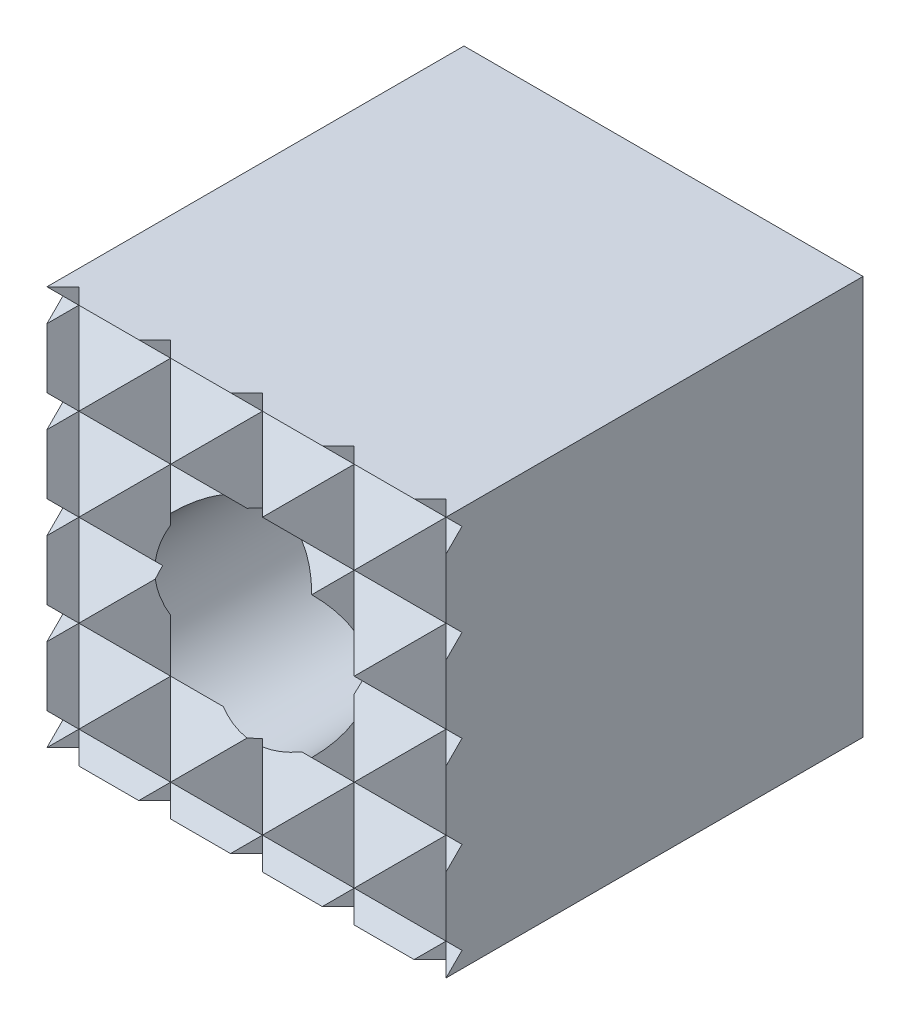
ISO-10303-21;
HEADER;
FILE_DESCRIPTION(('STEP AP214'),'2;1');
FILE_NAME('part.step','',(''),(''),'','','');
FILE_SCHEMA(('AUTOMOTIVE_DESIGN { 1 0 10303 214 1 1 1 1 }'));
ENDSEC;
DATA;
#1=APPLICATION_CONTEXT('core data for automotive mechanical design processes');
#2=APPLICATION_PROTOCOL_DEFINITION('international standard','automotive_design',2000,#1);
#3=PRODUCT_CONTEXT('',#1,'mechanical');
#4=PRODUCT('Part','Part','',(#3));
#5=PRODUCT_RELATED_PRODUCT_CATEGORY('part','',(#4));
#6=PRODUCT_DEFINITION_FORMATION('','',#4);
#7=PRODUCT_DEFINITION_CONTEXT('part definition',#1,'design');
#8=PRODUCT_DEFINITION('design','',#6,#7);
#9=PRODUCT_DEFINITION_SHAPE('','',#8);
#10=(LENGTH_UNIT() NAMED_UNIT(*) SI_UNIT(.MILLI.,.METRE.));
#11=(NAMED_UNIT(*) PLANE_ANGLE_UNIT() SI_UNIT($,.RADIAN.));
#12=(NAMED_UNIT(*) SI_UNIT($,.STERADIAN.) SOLID_ANGLE_UNIT());
#13=UNCERTAINTY_MEASURE_WITH_UNIT(LENGTH_MEASURE(1.E-05),#10,'distance_accuracy_value','');
#14=(GEOMETRIC_REPRESENTATION_CONTEXT(3) GLOBAL_UNCERTAINTY_ASSIGNED_CONTEXT((#13)) GLOBAL_UNIT_ASSIGNED_CONTEXT((#10,
#11,#12)) REPRESENTATION_CONTEXT('',''));
#15=CARTESIAN_POINT('',(0.,0.,0.));
#16=DIRECTION('',(0.,0.,1.));
#17=DIRECTION('',(1.,0.,0.));
#18=AXIS2_PLACEMENT_3D('',#15,#16,#17);
#19=CARTESIAN_POINT('',(-2.29999999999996,-10.,10.85));
#20=DIRECTION('',(0.707106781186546,0.,-0.70710678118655));
#21=DIRECTION('',(-0.70710678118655,0.,-0.707106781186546));
#22=AXIS2_PLACEMENT_3D('',#19,#20,#21);
#23=PLANE('',#22);
#24=DIRECTION('',(0.,1.,0.));
#25=VECTOR('',#24,1.);
#26=CARTESIAN_POINT('',(-2.29999999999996,-10.,10.85));
#27=LINE('',#26,#25);
#28=CARTESIAN_POINT('',(-2.29999999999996,-2.3,10.85));
#29=VERTEX_POINT('',#28);
#30=CARTESIAN_POINT('',(-2.29999999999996,-0.979795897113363,10.85));
#31=VERTEX_POINT('',#30);
#32=EDGE_CURVE('E471',#29,#31,#27,.T.);
#33=ORIENTED_EDGE('',*,*,#32,.F.);
#34=DIRECTION('',(0.577350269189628,0.577350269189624,0.577350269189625));
#35=VECTOR('',#34,1.);
#36=CARTESIAN_POINT('',(-4.86666666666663,-4.86666666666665,8.28333333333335));
#37=LINE('',#36,#35);
#38=CARTESIAN_POINT('',(-1.76776695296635,-1.76776695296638,11.3822330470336));
#39=VERTEX_POINT('',#38);
#40=EDGE_CURVE('E666',#29,#39,#37,.T.);
#41=ORIENTED_EDGE('',*,*,#40,.T.);
#42=CARTESIAN_POINT('',(0.,0.,13.15));
#43=DIRECTION('',(0.707106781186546,0.,-0.70710678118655));
#44=DIRECTION('',(0.70710678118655,0.,0.707106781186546));
#45=AXIS2_PLACEMENT_3D('',#42,#43,#44);
#46=ELLIPSE('',#45,3.53553390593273,2.5);
#47=EDGE_CURVE('E577',#39,#31,#46,.T.);
#48=ORIENTED_EDGE('',*,*,#47,.T.);
#49=EDGE_LOOP('',(#33,#41,#48));
#50=FACE_BOUND('',#49,.T.);
#51=ADVANCED_FACE('F14',(#50),#23,.F.);
#52=CARTESIAN_POINT('',(-1.14999999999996,-10.,12.));
#53=DIRECTION('',(-0.70710678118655,0.,-0.707106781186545));
#54=DIRECTION('',(-0.707106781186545,0.,0.70710678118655));
#55=AXIS2_PLACEMENT_3D('',#52,#53,#54);
#56=PLANE('',#55);
#57=DIRECTION('',(-0.707106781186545,0.,0.70710678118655));
#58=VECTOR('',#57,1.);
#59=CARTESIAN_POINT('',(-3.07499999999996,5.,13.925));
#60=LINE('',#59,#58);
#61=CARTESIAN_POINT('',(0.,5.,10.85));
#62=VERTEX_POINT('',#61);
#63=CARTESIAN_POINT('',(-0.399999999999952,5.,11.25));
#64=VERTEX_POINT('',#63);
#65=EDGE_CURVE('E496',#62,#64,#60,.T.);
#66=ORIENTED_EDGE('',*,*,#65,.T.);
#67=DIRECTION('',(0.577350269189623,-0.577350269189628,-0.577350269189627));
#68=VECTOR('',#67,1.);
#69=CARTESIAN_POINT('',(4.1,0.499999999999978,6.75));
#70=LINE('',#69,#68);
#71=CARTESIAN_POINT('',(0.,4.6,10.85));
#72=VERTEX_POINT('',#71);
#73=EDGE_CURVE('E823',#64,#72,#70,.T.);
#74=ORIENTED_EDGE('',*,*,#73,.T.);
#75=DIRECTION('',(0.,1.,0.));
#76=VECTOR('',#75,1.);
#77=CARTESIAN_POINT('',(0.,-10.,10.85));
#78=LINE('',#77,#76);
#79=EDGE_CURVE('E449',#72,#62,#78,.T.);
#80=ORIENTED_EDGE('',*,*,#79,.T.);
#81=EDGE_LOOP('',(#66,#74,#80));
#82=FACE_BOUND('',#81,.T.);
#83=ADVANCED_FACE('F1088',(#82),#56,.F.);
#84=CARTESIAN_POINT('',(0.,-10.,10.85));
#85=DIRECTION('',(0.707106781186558,0.,-0.707106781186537));
#86=DIRECTION('',(-0.707106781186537,0.,-0.707106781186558));
#87=AXIS2_PLACEMENT_3D('',#84,#85,#86);
#88=PLANE('',#87);
#89=DIRECTION('',(0.577350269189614,0.577350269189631,0.577350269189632));
#90=VECTOR('',#89,1.);
#91=CARTESIAN_POINT('',(-1.79999999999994,-6.4,9.05));
#92=LINE('',#91,#90);
#93=CARTESIAN_POINT('',(0.,-4.6,10.85));
#94=VERTEX_POINT('',#93);
#95=CARTESIAN_POINT('',(1.15,-3.45,12.));
#96=VERTEX_POINT('',#95);
#97=EDGE_CURVE('E899',#94,#96,#92,.T.);
#98=ORIENTED_EDGE('',*,*,#97,.T.);
#99=DIRECTION('',(-0.577350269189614,0.577350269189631,-0.577350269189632));
#100=VECTOR('',#99,1.);
#101=CARTESIAN_POINT('',(2.56666666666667,-4.86666666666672,13.4166666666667));
#102=LINE('',#101,#100);
#103=CARTESIAN_POINT('',(0.192572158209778,-2.49257215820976,11.0425721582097));
#104=VERTEX_POINT('',#103);
#105=EDGE_CURVE('E944',#96,#104,#102,.T.);
#106=ORIENTED_EDGE('',*,*,#105,.T.);
#107=CARTESIAN_POINT('',(0.,0.,10.85));
#108=DIRECTION('',(0.707106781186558,0.,-0.707106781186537));
#109=DIRECTION('',(0.707106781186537,0.,0.707106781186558));
#110=AXIS2_PLACEMENT_3D('',#107,#108,#109);
#111=ELLIPSE('',#110,3.53553390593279,2.5);
#112=CARTESIAN_POINT('',(0.,-2.5,10.85));
#113=VERTEX_POINT('',#112);
#114=EDGE_CURVE('E585',#104,#113,#111,.T.);
#115=ORIENTED_EDGE('',*,*,#114,.T.);
#116=EDGE_CURVE('E448',#94,#113,#78,.T.);
#117=ORIENTED_EDGE('',*,*,#116,.F.);
#118=EDGE_LOOP('',(#98,#106,#115,#117));
#119=FACE_BOUND('',#118,.T.);
#120=ADVANCED_FACE('F961',(#119),#88,.F.);
#121=CARTESIAN_POINT('',(1.15,-10.,12.));
#122=DIRECTION('',(-0.70710678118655,0.,-0.707106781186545));
#123=DIRECTION('',(-0.707106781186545,0.,0.70710678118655));
#124=AXIS2_PLACEMENT_3D('',#121,#122,#123);
#125=PLANE('',#124);
#126=DIRECTION('',(-0.707106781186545,0.,0.70710678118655));
#127=VECTOR('',#126,1.);
#128=CARTESIAN_POINT('',(-1.92499999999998,5.,15.075));
#129=LINE('',#128,#127);
#130=CARTESIAN_POINT('',(2.29999999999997,5.,10.85));
#131=VERTEX_POINT('',#130);
#132=CARTESIAN_POINT('',(1.9,5.,11.25));
#133=VERTEX_POINT('',#132);
#134=EDGE_CURVE('E485',#131,#133,#129,.T.);
#135=ORIENTED_EDGE('',*,*,#134,.T.);
#136=DIRECTION('',(0.577350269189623,-0.577350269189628,-0.577350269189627));
#137=VECTOR('',#136,1.);
#138=CARTESIAN_POINT('',(6.4,0.499999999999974,6.75));
#139=LINE('',#138,#137);
#140=CARTESIAN_POINT('',(2.29999999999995,4.6,10.85));
#141=VERTEX_POINT('',#140);
#142=EDGE_CURVE('E833',#133,#141,#139,.T.);
#143=ORIENTED_EDGE('',*,*,#142,.T.);
#144=DIRECTION('',(0.,1.,0.));
#145=VECTOR('',#144,1.);
#146=CARTESIAN_POINT('',(2.29999999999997,-10.,10.85));
#147=LINE('',#146,#145);
#148=EDGE_CURVE('E460',#141,#131,#147,.T.);
#149=ORIENTED_EDGE('',*,*,#148,.T.);
#150=EDGE_LOOP('',(#135,#143,#149));
#151=FACE_BOUND('',#150,.T.);
#152=ADVANCED_FACE('F979',(#151),#125,.F.);
#153=CARTESIAN_POINT('',(2.29999999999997,0.97979589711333,10.85));
#154=VERTEX_POINT('',#153);
#155=CARTESIAN_POINT('',(2.29999999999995,2.3,10.85));
#156=VERTEX_POINT('',#155);
#157=EDGE_CURVE('E451',#154,#156,#147,.T.);
#158=ORIENTED_EDGE('',*,*,#157,.T.);
#159=DIRECTION('',(-0.577350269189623,-0.577350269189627,0.577350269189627));
#160=VECTOR('',#159,1.);
#161=CARTESIAN_POINT('',(-2.56666666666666,-2.56666666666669,15.7166666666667));
#162=LINE('',#161,#160);
#163=CARTESIAN_POINT('',(1.76776695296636,1.76776695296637,11.3822330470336));
#164=VERTEX_POINT('',#163);
#165=EDGE_CURVE('E438',#156,#164,#162,.T.);
#166=ORIENTED_EDGE('',*,*,#165,.T.);
#167=CARTESIAN_POINT('',(0.,0.,13.15));
#168=DIRECTION('',(-0.70710678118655,0.,-0.707106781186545));
#169=DIRECTION('',(-0.707106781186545,0.,0.70710678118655));
#170=AXIS2_PLACEMENT_3D('',#167,#168,#169);
#171=ELLIPSE('',#170,3.53553390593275,2.5);
#172=EDGE_CURVE('E589',#164,#154,#171,.T.);
#173=ORIENTED_EDGE('',*,*,#172,.T.);
#174=EDGE_LOOP('',(#158,#166,#173));
#175=FACE_BOUND('',#174,.T.);
#176=ADVANCED_FACE('F1146',(#175),#125,.F.);
#177=CARTESIAN_POINT('',(-2.29999999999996,4.6,10.85));
#178=VERTEX_POINT('',#177);
#179=CARTESIAN_POINT('',(-2.29999999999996,5.,10.85));
#180=VERTEX_POINT('',#179);
#181=EDGE_CURVE('E444',#178,#180,#27,.T.);
#182=ORIENTED_EDGE('',*,*,#181,.F.);
#183=DIRECTION('',(0.577350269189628,0.577350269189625,0.577350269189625));
#184=VECTOR('',#183,1.);
#185=CARTESIAN_POINT('',(-7.16666666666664,-0.266666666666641,5.98333333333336));
#186=LINE('',#185,#184);
#187=CARTESIAN_POINT('',(-1.9,5.,11.25));
#188=VERTEX_POINT('',#187);
#189=EDGE_CURVE('E810',#178,#188,#186,.T.);
#190=ORIENTED_EDGE('',*,*,#189,.T.);
#191=DIRECTION('',(-0.70710678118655,0.,-0.707106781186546));
#192=VECTOR('',#191,1.);
#193=CARTESIAN_POINT('',(-3.075,5.,10.075));
#194=LINE('',#193,#192);
#195=EDGE_CURVE('E501',#188,#180,#194,.T.);
#196=ORIENTED_EDGE('',*,*,#195,.T.);
#197=EDGE_LOOP('',(#182,#190,#196));
#198=FACE_BOUND('',#197,.T.);
#199=ADVANCED_FACE('F1095',(#198),#23,.F.);
#200=CARTESIAN_POINT('',(-2.29999999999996,0.97979589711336,10.85));
#201=VERTEX_POINT('',#200);
#202=CARTESIAN_POINT('',(-1.76776695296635,1.76776695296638,11.3822330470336));
#203=VERTEX_POINT('',#202);
#204=EDGE_CURVE('E574',#201,#203,#46,.T.);
#205=ORIENTED_EDGE('',*,*,#204,.T.);
#206=DIRECTION('',(-0.577350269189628,0.577350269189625,-0.577350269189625));
#207=VECTOR('',#206,1.);
#208=CARTESIAN_POINT('',(1.80000000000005,-1.8,14.95));
#209=LINE('',#208,#207);
#210=CARTESIAN_POINT('',(-2.29999999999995,2.3,10.85));
#211=VERTEX_POINT('',#210);
#212=EDGE_CURVE('E428',#203,#211,#209,.T.);
#213=ORIENTED_EDGE('',*,*,#212,.T.);
#214=EDGE_CURVE('E468',#201,#211,#27,.T.);
#215=ORIENTED_EDGE('',*,*,#214,.F.);
#216=EDGE_LOOP('',(#205,#213,#215));
#217=FACE_BOUND('',#216,.T.);
#218=ADVANCED_FACE('F743',(#217),#23,.F.);
#219=CARTESIAN_POINT('',(0.,0.,10.85));
#220=DIRECTION('',(-0.70710678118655,0.,-0.707106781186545));
#221=DIRECTION('',(-0.707106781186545,0.,0.70710678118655));
#222=AXIS2_PLACEMENT_3D('',#219,#220,#221);
#223=ELLIPSE('',#222,3.53553390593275,2.5);
#224=CARTESIAN_POINT('',(-0.192572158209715,-2.49257215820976,11.0425721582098));
#225=VERTEX_POINT('',#224);
#226=EDGE_CURVE('E578',#113,#225,#223,.T.);
#227=ORIENTED_EDGE('',*,*,#226,.T.);
#228=DIRECTION('',(-0.577350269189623,-0.577350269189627,0.577350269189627));
#229=VECTOR('',#228,1.);
#230=CARTESIAN_POINT('',(-3.33333333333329,-5.63333333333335,14.1833333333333));
#231=LINE('',#230,#229);
#232=CARTESIAN_POINT('',(-1.14999999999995,-3.45,12.));
#233=VERTEX_POINT('',#232);
#234=EDGE_CURVE('E929',#225,#233,#231,.T.);
#235=ORIENTED_EDGE('',*,*,#234,.T.);
#236=DIRECTION('',(0.577350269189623,-0.577350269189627,-0.577350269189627));
#237=VECTOR('',#236,1.);
#238=CARTESIAN_POINT('',(1.03333333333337,-5.63333333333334,9.81666666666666));
#239=LINE('',#238,#237);
#240=EDGE_CURVE('E37',#233,#94,#239,.T.);
#241=ORIENTED_EDGE('',*,*,#240,.T.);
#242=ORIENTED_EDGE('',*,*,#116,.T.);
#243=EDGE_LOOP('',(#227,#235,#241,#242));
#244=FACE_BOUND('',#243,.T.);
#245=ADVANCED_FACE('F963',(#244),#56,.F.);
#246=ORIENTED_EDGE('',*,*,#79,.F.);
#247=DIRECTION('',(0.577350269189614,0.577350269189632,0.577350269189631));
#248=VECTOR('',#247,1.);
#249=CARTESIAN_POINT('',(-4.86666666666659,-0.26666666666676,5.98333333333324));
#250=LINE('',#249,#248);
#251=CARTESIAN_POINT('',(0.400000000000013,5.,11.25));
#252=VERTEX_POINT('',#251);
#253=EDGE_CURVE('E829',#72,#252,#250,.T.);
#254=ORIENTED_EDGE('',*,*,#253,.T.);
#255=DIRECTION('',(-0.707106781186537,0.,-0.707106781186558));
#256=VECTOR('',#255,1.);
#257=CARTESIAN_POINT('',(-1.92499999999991,5.,8.925));
#258=LINE('',#257,#256);
#259=EDGE_CURVE('E490',#252,#62,#258,.T.);
#260=ORIENTED_EDGE('',*,*,#259,.T.);
#261=EDGE_LOOP('',(#246,#254,#260));
#262=FACE_BOUND('',#261,.T.);
#263=ADVANCED_FACE('F1091',(#262),#88,.F.);
#264=CARTESIAN_POINT('',(2.29999999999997,-0.97979589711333,10.85));
#265=VERTEX_POINT('',#264);
#266=CARTESIAN_POINT('',(1.76776695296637,-1.76776695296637,11.3822330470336));
#267=VERTEX_POINT('',#266);
#268=EDGE_CURVE('E586',#265,#267,#171,.T.);
#269=ORIENTED_EDGE('',*,*,#268,.T.);
#270=DIRECTION('',(0.577350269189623,-0.577350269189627,-0.577350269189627));
#271=VECTOR('',#270,1.);
#272=CARTESIAN_POINT('',(4.1,-4.1,9.05));
#273=LINE('',#272,#271);
#274=CARTESIAN_POINT('',(2.29999999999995,-2.3,10.85));
#275=VERTEX_POINT('',#274);
#276=EDGE_CURVE('E690',#267,#275,#273,.T.);
#277=ORIENTED_EDGE('',*,*,#276,.T.);
#278=EDGE_CURVE('E454',#275,#265,#147,.T.);
#279=ORIENTED_EDGE('',*,*,#278,.T.);
#280=EDGE_LOOP('',(#269,#277,#279));
#281=FACE_BOUND('',#280,.T.);
#282=ADVANCED_FACE('F1152',(#281),#125,.F.);
#283=CARTESIAN_POINT('',(2.29999999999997,-10.,10.85));
#284=DIRECTION('',(0.707106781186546,0.,-0.70710678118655));
#285=DIRECTION('',(-0.70710678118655,0.,-0.707106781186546));
#286=AXIS2_PLACEMENT_3D('',#283,#284,#285);
#287=PLANE('',#286);
#288=DIRECTION('',(0.577350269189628,0.577350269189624,0.577350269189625));
#289=VECTOR('',#288,1.);
#290=CARTESIAN_POINT('',(-0.266666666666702,-4.86666666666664,8.28333333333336));
#291=LINE('',#290,#289);
#292=CARTESIAN_POINT('',(3.44999999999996,-1.15,12.));
#293=VERTEX_POINT('',#292);
#294=EDGE_CURVE('E687',#275,#293,#291,.T.);
#295=ORIENTED_EDGE('',*,*,#294,.T.);
#296=DIRECTION('',(-0.577350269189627,0.577350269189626,-0.577350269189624));
#297=VECTOR('',#296,1.);
#298=CARTESIAN_POINT('',(5.63333333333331,-3.33333333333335,14.1833333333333));
#299=LINE('',#298,#297);
#300=CARTESIAN_POINT('',(2.49257215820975,-0.192572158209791,11.0425721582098));
#301=VERTEX_POINT('',#300);
#302=EDGE_CURVE('E708',#293,#301,#299,.T.);
#303=ORIENTED_EDGE('',*,*,#302,.T.);
#304=CARTESIAN_POINT('',(0.,0.,8.55));
#305=DIRECTION('',(0.707106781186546,0.,-0.70710678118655));
#306=DIRECTION('',(0.70710678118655,0.,0.707106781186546));
#307=AXIS2_PLACEMENT_3D('',#304,#305,#306);
#308=ELLIPSE('',#307,3.53553390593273,2.5);
#309=EDGE_CURVE('E594',#301,#265,#308,.T.);
#310=ORIENTED_EDGE('',*,*,#309,.T.);
#311=ORIENTED_EDGE('',*,*,#278,.F.);
#312=EDGE_LOOP('',(#295,#303,#310,#311));
#313=FACE_BOUND('',#312,.T.);
#314=ADVANCED_FACE('F1160',(#313),#287,.F.);
#315=DIRECTION('',(0.70710678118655,0.,0.707106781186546));
#316=VECTOR('',#315,1.);
#317=CARTESIAN_POINT('',(4.225,-5.,12.775));
#318=LINE('',#317,#316);
#319=CARTESIAN_POINT('',(2.29999999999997,-5.,10.85));
#320=VERTEX_POINT('',#319);
#321=CARTESIAN_POINT('',(2.69999999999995,-5.,11.25));
#322=VERTEX_POINT('',#321);
#323=EDGE_CURVE('E482',#320,#322,#318,.T.);
#324=ORIENTED_EDGE('',*,*,#323,.T.);
#325=DIRECTION('',(-0.577350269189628,0.577350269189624,-0.577350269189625));
#326=VECTOR('',#325,1.);
#327=CARTESIAN_POINT('',(4.1,-6.4,12.65));
#328=LINE('',#327,#326);
#329=CARTESIAN_POINT('',(2.29999999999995,-4.6,10.85));
#330=VERTEX_POINT('',#329);
#331=EDGE_CURVE('E874',#322,#330,#328,.T.);
#332=ORIENTED_EDGE('',*,*,#331,.T.);
#333=EDGE_CURVE('E456',#320,#330,#147,.T.);
#334=ORIENTED_EDGE('',*,*,#333,.F.);
#335=EDGE_LOOP('',(#324,#332,#334));
#336=FACE_BOUND('',#335,.T.);
#337=ADVANCED_FACE('F1167',(#336),#287,.F.);
#338=ORIENTED_EDGE('',*,*,#148,.F.);
#339=DIRECTION('',(0.577350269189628,0.577350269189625,0.577350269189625));
#340=VECTOR('',#339,1.);
#341=CARTESIAN_POINT('',(-2.56666666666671,-0.266666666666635,5.98333333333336));
#342=LINE('',#341,#340);
#343=CARTESIAN_POINT('',(2.69999999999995,5.,11.25));
#344=VERTEX_POINT('',#343);
#345=EDGE_CURVE('E836',#141,#344,#342,.T.);
#346=ORIENTED_EDGE('',*,*,#345,.T.);
#347=DIRECTION('',(-0.70710678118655,0.,-0.707106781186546));
#348=VECTOR('',#347,1.);
#349=CARTESIAN_POINT('',(-0.775000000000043,5.,7.775));
#350=LINE('',#349,#348);
#351=EDGE_CURVE('E479',#344,#131,#350,.T.);
#352=ORIENTED_EDGE('',*,*,#351,.T.);
#353=EDGE_LOOP('',(#338,#346,#352));
#354=FACE_BOUND('',#353,.T.);
#355=ADVANCED_FACE('F983',(#354),#287,.F.);
#356=CARTESIAN_POINT('',(2.49257215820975,0.192572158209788,11.0425721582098));
#357=VERTEX_POINT('',#356);
#358=EDGE_CURVE('E590',#154,#357,#308,.T.);
#359=ORIENTED_EDGE('',*,*,#358,.T.);
#360=DIRECTION('',(0.577350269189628,0.577350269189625,0.577350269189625));
#361=VECTOR('',#360,1.);
#362=CARTESIAN_POINT('',(-1.03333333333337,-3.33333333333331,7.51666666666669));
#363=LINE('',#362,#361);
#364=CARTESIAN_POINT('',(3.44999999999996,1.15,12.));
#365=VERTEX_POINT('',#364);
#366=EDGE_CURVE('E731',#357,#365,#363,.T.);
#367=ORIENTED_EDGE('',*,*,#366,.T.);
#368=DIRECTION('',(-0.577350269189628,0.577350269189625,-0.577350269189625));
#369=VECTOR('',#368,1.);
#370=CARTESIAN_POINT('',(6.4,-1.8,14.95));
#371=LINE('',#370,#369);
#372=EDGE_CURVE('E435',#365,#156,#371,.T.);
#373=ORIENTED_EDGE('',*,*,#372,.T.);
#374=ORIENTED_EDGE('',*,*,#157,.F.);
#375=EDGE_LOOP('',(#359,#367,#373,#374));
#376=FACE_BOUND('',#375,.T.);
#377=ADVANCED_FACE('F1191',(#376),#287,.F.);
#378=CARTESIAN_POINT('',(3.44999999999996,-10.,12.));
#379=DIRECTION('',(-0.70710678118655,0.,-0.707106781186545));
#380=DIRECTION('',(-0.707106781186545,0.,0.70710678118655));
#381=AXIS2_PLACEMENT_3D('',#378,#379,#380);
#382=PLANE('',#381);
#383=DIRECTION('',(0.,1.,0.));
#384=VECTOR('',#383,1.);
#385=CARTESIAN_POINT('',(4.6,-10.,10.85));
#386=LINE('',#385,#384);
#387=CARTESIAN_POINT('',(4.6,-5.,10.85));
#388=VERTEX_POINT('',#387);
#389=CARTESIAN_POINT('',(4.6,-4.6,10.85));
#390=VERTEX_POINT('',#389);
#391=EDGE_CURVE('E457',#388,#390,#386,.T.);
#392=ORIENTED_EDGE('',*,*,#391,.T.);
#393=DIRECTION('',(-0.577350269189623,-0.577350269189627,0.577350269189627));
#394=VECTOR('',#393,1.);
#395=CARTESIAN_POINT('',(2.0333333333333,-7.16666666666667,13.4166666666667));
#396=LINE('',#395,#394);
#397=CARTESIAN_POINT('',(4.2,-5.,11.25));
#398=VERTEX_POINT('',#397);
#399=EDGE_CURVE('E877',#390,#398,#396,.T.);
#400=ORIENTED_EDGE('',*,*,#399,.T.);
#401=DIRECTION('',(0.707106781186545,0.,-0.70710678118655));
#402=VECTOR('',#401,1.);
#403=CARTESIAN_POINT('',(4.225,-5.,11.225));
#404=LINE('',#403,#402);
#405=EDGE_CURVE('E522',#398,#388,#404,.T.);
#406=ORIENTED_EDGE('',*,*,#405,.T.);
#407=EDGE_LOOP('',(#392,#400,#406));
#408=FACE_BOUND('',#407,.T.);
#409=ADVANCED_FACE('F1202',(#408),#382,.F.);
#410=DIRECTION('',(-0.577350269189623,-0.577350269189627,0.577350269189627));
#411=VECTOR('',#410,1.);
#412=CARTESIAN_POINT('',(1.26666666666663,-5.63333333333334,14.1833333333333));
#413=LINE('',#412,#411);
#414=CARTESIAN_POINT('',(4.6,-2.3,10.85));
#415=VERTEX_POINT('',#414);
#416=CARTESIAN_POINT('',(3.44999999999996,-3.45,12.));
#417=VERTEX_POINT('',#416);
#418=EDGE_CURVE('E937',#415,#417,#413,.T.);
#419=ORIENTED_EDGE('',*,*,#418,.T.);
#420=DIRECTION('',(0.577350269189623,-0.577350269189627,-0.577350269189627));
#421=VECTOR('',#420,1.);
#422=CARTESIAN_POINT('',(5.63333333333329,-5.63333333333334,9.81666666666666));
#423=LINE('',#422,#421);
#424=EDGE_CURVE('E908',#417,#390,#423,.T.);
#425=ORIENTED_EDGE('',*,*,#424,.T.);
#426=EDGE_CURVE('E461',#390,#415,#386,.T.);
#427=ORIENTED_EDGE('',*,*,#426,.T.);
#428=EDGE_LOOP('',(#419,#425,#427));
#429=FACE_BOUND('',#428,.T.);
#430=ADVANCED_FACE('F1239',(#429),#382,.F.);
#431=DIRECTION('',(-0.577350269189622,-0.577350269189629,0.577350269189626));
#432=VECTOR('',#431,1.);
#433=CARTESIAN_POINT('',(0.499999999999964,-4.1,14.95));
#434=LINE('',#433,#432);
#435=CARTESIAN_POINT('',(4.6,0.,10.85));
#436=VERTEX_POINT('',#435);
#437=EDGE_CURVE('E705',#436,#293,#434,.T.);
#438=ORIENTED_EDGE('',*,*,#437,.T.);
#439=DIRECTION('',(0.577350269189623,-0.577350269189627,-0.577350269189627));
#440=VECTOR('',#439,1.);
#441=CARTESIAN_POINT('',(6.4,-4.1,9.05));
#442=LINE('',#441,#440);
#443=EDGE_CURVE('E684',#293,#415,#442,.T.);
#444=ORIENTED_EDGE('',*,*,#443,.T.);
#445=EDGE_CURVE('E1248',#415,#436,#386,.T.);
#446=ORIENTED_EDGE('',*,*,#445,.T.);
#447=EDGE_LOOP('',(#438,#444,#446));
#448=FACE_BOUND('',#447,.T.);
#449=ADVANCED_FACE('F1503',(#448),#382,.F.);
#450=DIRECTION('',(-0.707106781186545,0.,0.70710678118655));
#451=VECTOR('',#450,1.);
#452=CARTESIAN_POINT('',(-0.77499999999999,5.,16.225));
#453=LINE('',#452,#451);
#454=CARTESIAN_POINT('',(4.6,5.,10.85));
#455=VERTEX_POINT('',#454);
#456=CARTESIAN_POINT('',(4.2,5.,11.25));
#457=VERTEX_POINT('',#456);
#458=EDGE_CURVE('E600',#455,#457,#453,.T.);
#459=ORIENTED_EDGE('',*,*,#458,.T.);
#460=DIRECTION('',(0.577350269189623,-0.577350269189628,-0.577350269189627));
#461=VECTOR('',#460,1.);
#462=CARTESIAN_POINT('',(8.7,0.499999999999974,6.75));
#463=LINE('',#462,#461);
#464=CARTESIAN_POINT('',(4.6,4.6,10.85));
#465=VERTEX_POINT('',#464);
#466=EDGE_CURVE('E839',#457,#465,#463,.T.);
#467=ORIENTED_EDGE('',*,*,#466,.T.);
#468=EDGE_CURVE('E462',#465,#455,#386,.T.);
#469=ORIENTED_EDGE('',*,*,#468,.T.);
#470=EDGE_LOOP('',(#459,#467,#469));
#471=FACE_BOUND('',#470,.T.);
#472=ADVANCED_FACE('F1000',(#471),#382,.F.);
#473=DIRECTION('',(-0.577350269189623,-0.577350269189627,0.577350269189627));
#474=VECTOR('',#473,1.);
#475=CARTESIAN_POINT('',(-0.266666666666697,-2.56666666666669,15.7166666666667));
#476=LINE('',#475,#474);
#477=CARTESIAN_POINT('',(4.6,2.3,10.85));
#478=VERTEX_POINT('',#477);
#479=EDGE_CURVE('E426',#478,#365,#476,.T.);
#480=ORIENTED_EDGE('',*,*,#479,.T.);
#481=DIRECTION('',(0.577350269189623,-0.577350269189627,-0.577350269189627));
#482=VECTOR('',#481,1.);
#483=CARTESIAN_POINT('',(7.16666666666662,-2.56666666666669,8.28333333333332));
#484=LINE('',#483,#482);
#485=EDGE_CURVE('E728',#365,#436,#484,.T.);
#486=ORIENTED_EDGE('',*,*,#485,.T.);
#487=EDGE_CURVE('E1250',#436,#478,#386,.T.);
#488=ORIENTED_EDGE('',*,*,#487,.T.);
#489=EDGE_LOOP('',(#480,#486,#488));
#490=FACE_BOUND('',#489,.T.);
#491=ADVANCED_FACE('F1203',(#490),#382,.F.);
#492=CARTESIAN_POINT('',(4.6,-10.,10.85));
#493=DIRECTION('',(0.707106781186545,0.,-0.70710678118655));
#494=DIRECTION('',(-0.70710678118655,0.,-0.707106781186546));
#495=AXIS2_PLACEMENT_3D('',#492,#493,#494);
#496=PLANE('',#495);
#497=ORIENTED_EDGE('',*,*,#487,.F.);
#498=DIRECTION('',(0.577350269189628,0.577350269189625,0.577350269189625));
#499=VECTOR('',#498,1.);
#500=CARTESIAN_POINT('',(1.26666666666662,-3.33333333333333,7.51666666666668));
#501=LINE('',#500,#499);
#502=CARTESIAN_POINT('',(5.,0.400000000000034,11.25));
#503=VERTEX_POINT('',#502);
#504=EDGE_CURVE('E725',#436,#503,#501,.T.);
#505=ORIENTED_EDGE('',*,*,#504,.T.);
#506=DIRECTION('',(0.,-1.,0.));
#507=VECTOR('',#506,1.);
#508=CARTESIAN_POINT('',(5.,-5.,11.25));
#509=LINE('',#508,#507);
#510=CARTESIAN_POINT('',(5.,1.89999999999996,11.25));
#511=VERTEX_POINT('',#510);
#512=EDGE_CURVE('E1268',#511,#503,#509,.T.);
#513=ORIENTED_EDGE('',*,*,#512,.F.);
#514=DIRECTION('',(-0.577350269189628,0.577350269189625,-0.577350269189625));
#515=VECTOR('',#514,1.);
#516=CARTESIAN_POINT('',(8.7,-1.8,14.95));
#517=LINE('',#516,#515);
#518=EDGE_CURVE('E422',#511,#478,#517,.T.);
#519=ORIENTED_EDGE('',*,*,#518,.T.);
#520=EDGE_LOOP('',(#497,#505,#513,#519));
#521=FACE_BOUND('',#520,.T.);
#522=ADVANCED_FACE('F1392',(#521),#496,.F.);
#523=CARTESIAN_POINT('',(5.,-0.400000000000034,11.25));
#524=VERTEX_POINT('',#523);
#525=CARTESIAN_POINT('',(5.,-1.89999999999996,11.25));
#526=VERTEX_POINT('',#525);
#527=EDGE_CURVE('E517',#524,#526,#509,.T.);
#528=ORIENTED_EDGE('',*,*,#527,.F.);
#529=DIRECTION('',(-0.577350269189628,0.577350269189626,-0.577350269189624));
#530=VECTOR('',#529,1.);
#531=CARTESIAN_POINT('',(7.9333333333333,-3.33333333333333,14.1833333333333));
#532=LINE('',#531,#530);
#533=EDGE_CURVE('E702',#524,#436,#532,.T.);
#534=ORIENTED_EDGE('',*,*,#533,.T.);
#535=ORIENTED_EDGE('',*,*,#445,.F.);
#536=DIRECTION('',(0.577350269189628,0.577350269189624,0.577350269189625));
#537=VECTOR('',#536,1.);
#538=CARTESIAN_POINT('',(2.03333333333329,-4.86666666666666,8.28333333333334));
#539=LINE('',#538,#537);
#540=EDGE_CURVE('E681',#415,#526,#539,.T.);
#541=ORIENTED_EDGE('',*,*,#540,.T.);
#542=EDGE_LOOP('',(#528,#534,#535,#541));
#543=FACE_BOUND('',#542,.T.);
#544=ADVANCED_FACE('F1273',(#543),#496,.F.);
#545=CARTESIAN_POINT('',(5.,-2.70000000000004,11.25));
#546=VERTEX_POINT('',#545);
#547=CARTESIAN_POINT('',(5.,-4.2,11.25));
#548=VERTEX_POINT('',#547);
#549=EDGE_CURVE('E514',#546,#548,#509,.T.);
#550=ORIENTED_EDGE('',*,*,#549,.F.);
#551=DIRECTION('',(-0.577350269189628,0.577350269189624,-0.577350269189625));
#552=VECTOR('',#551,1.);
#553=CARTESIAN_POINT('',(7.16666666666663,-4.86666666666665,13.4166666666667));
#554=LINE('',#553,#552);
#555=EDGE_CURVE('E934',#546,#415,#554,.T.);
#556=ORIENTED_EDGE('',*,*,#555,.T.);
#557=ORIENTED_EDGE('',*,*,#426,.F.);
#558=DIRECTION('',(0.577350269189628,0.577350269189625,0.577350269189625));
#559=VECTOR('',#558,1.);
#560=CARTESIAN_POINT('',(2.79999999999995,-6.4,9.05));
#561=LINE('',#560,#559);
#562=EDGE_CURVE('E911',#390,#548,#561,.T.);
#563=ORIENTED_EDGE('',*,*,#562,.T.);
#564=EDGE_LOOP('',(#550,#556,#557,#563));
#565=FACE_BOUND('',#564,.T.);
#566=ADVANCED_FACE('F1246',(#565),#496,.F.);
#567=ORIENTED_EDGE('',*,*,#468,.F.);
#568=DIRECTION('',(0.577350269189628,0.577350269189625,0.577350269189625));
#569=VECTOR('',#568,1.);
#570=CARTESIAN_POINT('',(-0.266666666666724,-0.266666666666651,5.98333333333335));
#571=LINE('',#570,#569);
#572=CARTESIAN_POINT('',(5.,5.,11.25));
#573=VERTEX_POINT('',#572);
#574=EDGE_CURVE('E842',#465,#573,#571,.T.);
#575=ORIENTED_EDGE('',*,*,#574,.T.);
#576=DIRECTION('',(-0.70710678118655,0.,-0.707106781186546));
#577=VECTOR('',#576,1.);
#578=CARTESIAN_POINT('',(0.37499999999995,5.,6.625));
#579=LINE('',#578,#577);
#580=EDGE_CURVE('E603',#573,#455,#579,.T.);
#581=ORIENTED_EDGE('',*,*,#580,.T.);
#582=EDGE_LOOP('',(#567,#575,#581));
#583=FACE_BOUND('',#582,.T.);
#584=ADVANCED_FACE('F1004',(#583),#496,.F.);
#585=DIRECTION('',(0.70710678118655,0.,0.707106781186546));
#586=VECTOR('',#585,1.);
#587=CARTESIAN_POINT('',(5.375,-5.,11.625));
#588=LINE('',#587,#586);
#589=CARTESIAN_POINT('',(5.,-5.,11.25));
#590=VERTEX_POINT('',#589);
#591=EDGE_CURVE('E519',#388,#590,#588,.T.);
#592=ORIENTED_EDGE('',*,*,#591,.T.);
#593=DIRECTION('',(-0.577350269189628,0.577350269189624,-0.577350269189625));
#594=VECTOR('',#593,1.);
#595=CARTESIAN_POINT('',(6.4,-6.4,12.65));
#596=LINE('',#595,#594);
#597=EDGE_CURVE('E880',#590,#390,#596,.T.);
#598=ORIENTED_EDGE('',*,*,#597,.T.);
#599=ORIENTED_EDGE('',*,*,#391,.F.);
#600=EDGE_LOOP('',(#592,#598,#599));
#601=FACE_BOUND('',#600,.T.);
#602=ADVANCED_FACE('F1233',(#601),#496,.F.);
#603=CARTESIAN_POINT('',(-5.75,-10.,12.));
#604=DIRECTION('',(-0.70710678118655,0.,-0.707106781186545));
#605=DIRECTION('',(-0.707106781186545,0.,0.70710678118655));
#606=AXIS2_PLACEMENT_3D('',#603,#604,#605);
#607=PLANE('',#606);
#608=DIRECTION('',(0.,1.,0.));
#609=VECTOR('',#608,1.);
#610=CARTESIAN_POINT('',(-5.,5.,11.25));
#611=LINE('',#610,#609);
#612=CARTESIAN_POINT('',(-5.,0.400000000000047,11.25));
#613=VERTEX_POINT('',#612);
#614=CARTESIAN_POINT('',(-5.,1.89999999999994,11.25));
#615=VERTEX_POINT('',#614);
#616=EDGE_CURVE('E421',#613,#615,#611,.T.);
#617=ORIENTED_EDGE('',*,*,#616,.F.);
#618=DIRECTION('',(0.577350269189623,-0.577350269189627,-0.577350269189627));
#619=VECTOR('',#618,1.);
#620=CARTESIAN_POINT('',(-2.0333333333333,-2.56666666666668,8.28333333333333));
#621=LINE('',#620,#619);
#622=CARTESIAN_POINT('',(-4.6,0.,10.85));
#623=VERTEX_POINT('',#622);
#624=EDGE_CURVE('E717',#613,#623,#621,.T.);
#625=ORIENTED_EDGE('',*,*,#624,.T.);
#626=DIRECTION('',(0.,1.,0.));
#627=VECTOR('',#626,1.);
#628=CARTESIAN_POINT('',(-4.6,-10.,10.85));
#629=LINE('',#628,#627);
#630=CARTESIAN_POINT('',(-4.6,2.3,10.85));
#631=VERTEX_POINT('',#630);
#632=EDGE_CURVE('E1313',#623,#631,#629,.T.);
#633=ORIENTED_EDGE('',*,*,#632,.T.);
#634=DIRECTION('',(-0.577350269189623,-0.577350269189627,0.577350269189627));
#635=VECTOR('',#634,1.);
#636=CARTESIAN_POINT('',(-9.46666666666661,-2.56666666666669,15.7166666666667));
#637=LINE('',#636,#635);
#638=EDGE_CURVE('E410',#631,#615,#637,.T.);
#639=ORIENTED_EDGE('',*,*,#638,.T.);
#640=EDGE_LOOP('',(#617,#625,#633,#639));
#641=FACE_BOUND('',#640,.T.);
#642=ADVANCED_FACE('F1316',(#641),#607,.F.);
#643=CARTESIAN_POINT('',(-4.6,-2.3,10.85));
#644=VERTEX_POINT('',#643);
#645=EDGE_CURVE('E661',#644,#623,#629,.T.);
#646=ORIENTED_EDGE('',*,*,#645,.T.);
#647=DIRECTION('',(-0.577350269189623,-0.577350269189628,0.577350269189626));
#648=VECTOR('',#647,1.);
#649=CARTESIAN_POINT('',(-8.7,-4.1,14.95));
#650=LINE('',#649,#648);
#651=CARTESIAN_POINT('',(-5.,-0.400000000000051,11.25));
#652=VERTEX_POINT('',#651);
#653=EDGE_CURVE('E657',#623,#652,#650,.T.);
#654=ORIENTED_EDGE('',*,*,#653,.T.);
#655=CARTESIAN_POINT('',(-5.,-1.89999999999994,11.25));
#656=VERTEX_POINT('',#655);
#657=EDGE_CURVE('E1320',#656,#652,#611,.T.);
#658=ORIENTED_EDGE('',*,*,#657,.F.);
#659=DIRECTION('',(0.577350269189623,-0.577350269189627,-0.577350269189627));
#660=VECTOR('',#659,1.);
#661=CARTESIAN_POINT('',(-2.79999999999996,-4.1,9.05));
#662=LINE('',#661,#660);
#663=EDGE_CURVE('E663',#656,#644,#662,.T.);
#664=ORIENTED_EDGE('',*,*,#663,.T.);
#665=EDGE_LOOP('',(#646,#654,#658,#664));
#666=FACE_BOUND('',#665,.T.);
#667=ADVANCED_FACE('F1324',(#666),#607,.F.);
#668=CARTESIAN_POINT('',(-4.6,-4.6,10.85));
#669=VERTEX_POINT('',#668);
#670=EDGE_CURVE('E466',#669,#644,#629,.T.);
#671=ORIENTED_EDGE('',*,*,#670,.T.);
#672=DIRECTION('',(-0.577350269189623,-0.577350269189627,0.577350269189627));
#673=VECTOR('',#672,1.);
#674=CARTESIAN_POINT('',(-7.93333333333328,-5.63333333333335,14.1833333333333));
#675=LINE('',#674,#673);
#676=CARTESIAN_POINT('',(-5.,-2.70000000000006,11.25));
#677=VERTEX_POINT('',#676);
#678=EDGE_CURVE('E920',#644,#677,#675,.T.);
#679=ORIENTED_EDGE('',*,*,#678,.T.);
#680=CARTESIAN_POINT('',(-5.,-4.19999999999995,11.25));
#681=VERTEX_POINT('',#680);
#682=EDGE_CURVE('E511',#681,#677,#611,.T.);
#683=ORIENTED_EDGE('',*,*,#682,.F.);
#684=DIRECTION('',(0.577350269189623,-0.577350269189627,-0.577350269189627));
#685=VECTOR('',#684,1.);
#686=CARTESIAN_POINT('',(-3.56666666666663,-5.63333333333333,9.81666666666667));
#687=LINE('',#686,#685);
#688=EDGE_CURVE('E889',#681,#669,#687,.T.);
#689=ORIENTED_EDGE('',*,*,#688,.T.);
#690=EDGE_LOOP('',(#671,#679,#683,#689));
#691=FACE_BOUND('',#690,.T.);
#692=ADVANCED_FACE('F1328',(#691),#607,.F.);
#693=DIRECTION('',(-0.707106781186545,0.,0.70710678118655));
#694=VECTOR('',#693,1.);
#695=CARTESIAN_POINT('',(-5.375,5.,11.625));
#696=LINE('',#695,#694);
#697=CARTESIAN_POINT('',(-4.6,5.,10.85));
#698=VERTEX_POINT('',#697);
#699=CARTESIAN_POINT('',(-4.99999999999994,5.,11.25));
#700=VERTEX_POINT('',#699);
#701=EDGE_CURVE('E597',#698,#700,#696,.T.);
#702=ORIENTED_EDGE('',*,*,#701,.T.);
#703=DIRECTION('',(0.577350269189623,-0.577350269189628,-0.577350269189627));
#704=VECTOR('',#703,1.);
#705=CARTESIAN_POINT('',(-0.499999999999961,0.499999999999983,6.75));
#706=LINE('',#705,#704);
#707=CARTESIAN_POINT('',(-4.6,4.6,10.85));
#708=VERTEX_POINT('',#707);
#709=EDGE_CURVE('E820',#700,#708,#706,.T.);
#710=ORIENTED_EDGE('',*,*,#709,.T.);
#711=EDGE_CURVE('E467',#708,#698,#629,.T.);
#712=ORIENTED_EDGE('',*,*,#711,.T.);
#713=EDGE_LOOP('',(#702,#710,#712));
#714=FACE_BOUND('',#713,.T.);
#715=ADVANCED_FACE('F1034',(#714),#607,.F.);
#716=CARTESIAN_POINT('',(-4.6,-5.,10.85));
#717=VERTEX_POINT('',#716);
#718=EDGE_CURVE('E463',#717,#669,#629,.T.);
#719=ORIENTED_EDGE('',*,*,#718,.T.);
#720=DIRECTION('',(-0.577350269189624,-0.577350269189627,0.577350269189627));
#721=VECTOR('',#720,1.);
#722=CARTESIAN_POINT('',(-7.16666666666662,-7.16666666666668,13.4166666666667));
#723=LINE('',#722,#721);
#724=CARTESIAN_POINT('',(-5.,-5.,11.25));
#725=VERTEX_POINT('',#724);
#726=EDGE_CURVE('E858',#669,#725,#723,.T.);
#727=ORIENTED_EDGE('',*,*,#726,.T.);
#728=DIRECTION('',(0.707106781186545,0.,-0.70710678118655));
#729=VECTOR('',#728,1.);
#730=CARTESIAN_POINT('',(-0.375000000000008,-5.,6.625));
#731=LINE('',#730,#729);
#732=EDGE_CURVE('E512',#725,#717,#731,.T.);
#733=ORIENTED_EDGE('',*,*,#732,.T.);
#734=EDGE_LOOP('',(#719,#727,#733));
#735=FACE_BOUND('',#734,.T.);
#736=ADVANCED_FACE('F1396',(#735),#607,.F.);
#737=CARTESIAN_POINT('',(-4.6,-10.,10.85));
#738=DIRECTION('',(0.707106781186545,0.,-0.70710678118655));
#739=DIRECTION('',(-0.70710678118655,0.,-0.707106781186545));
#740=AXIS2_PLACEMENT_3D('',#737,#738,#739);
#741=PLANE('',#740);
#742=DIRECTION('',(0.70710678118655,0.,0.707106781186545));
#743=VECTOR('',#742,1.);
#744=CARTESIAN_POINT('',(0.77500000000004,-5.,16.225));
#745=LINE('',#744,#743);
#746=CARTESIAN_POINT('',(-4.2,-5.,11.25));
#747=VERTEX_POINT('',#746);
#748=EDGE_CURVE('E506',#717,#747,#745,.T.);
#749=ORIENTED_EDGE('',*,*,#748,.T.);
#750=DIRECTION('',(-0.577350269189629,0.577350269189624,-0.577350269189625));
#751=VECTOR('',#750,1.);
#752=CARTESIAN_POINT('',(-2.8,-6.4,12.65));
#753=LINE('',#752,#751);
#754=EDGE_CURVE('E855',#747,#669,#753,.T.);
#755=ORIENTED_EDGE('',*,*,#754,.T.);
#756=ORIENTED_EDGE('',*,*,#718,.F.);
#757=EDGE_LOOP('',(#749,#755,#756));
#758=FACE_BOUND('',#757,.T.);
#759=ADVANCED_FACE('F1399',(#758),#741,.F.);
#760=ORIENTED_EDGE('',*,*,#670,.F.);
#761=DIRECTION('',(0.577350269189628,0.577350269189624,0.577350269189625));
#762=VECTOR('',#761,1.);
#763=CARTESIAN_POINT('',(-6.4,-6.4,9.05));
#764=LINE('',#763,#762);
#765=CARTESIAN_POINT('',(-3.44999999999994,-3.45,12.));
#766=VERTEX_POINT('',#765);
#767=EDGE_CURVE('E886',#669,#766,#764,.T.);
#768=ORIENTED_EDGE('',*,*,#767,.T.);
#769=DIRECTION('',(-0.577350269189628,0.577350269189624,-0.577350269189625));
#770=VECTOR('',#769,1.);
#771=CARTESIAN_POINT('',(-2.0333333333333,-4.86666666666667,13.4166666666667));
#772=LINE('',#771,#770);
#773=EDGE_CURVE('E917',#766,#644,#772,.T.);
#774=ORIENTED_EDGE('',*,*,#773,.T.);
#775=EDGE_LOOP('',(#760,#768,#774));
#776=FACE_BOUND('',#775,.T.);
#777=ADVANCED_FACE('F1333',(#776),#741,.F.);
#778=ORIENTED_EDGE('',*,*,#645,.F.);
#779=DIRECTION('',(0.577350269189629,0.577350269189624,0.577350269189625));
#780=VECTOR('',#779,1.);
#781=CARTESIAN_POINT('',(-7.16666666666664,-4.86666666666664,8.28333333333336));
#782=LINE('',#781,#780);
#783=CARTESIAN_POINT('',(-3.44999999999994,-1.15,12.));
#784=VERTEX_POINT('',#783);
#785=EDGE_CURVE('E641',#644,#784,#782,.T.);
#786=ORIENTED_EDGE('',*,*,#785,.T.);
#787=DIRECTION('',(-0.577350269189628,0.577350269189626,-0.577350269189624));
#788=VECTOR('',#787,1.);
#789=CARTESIAN_POINT('',(-1.26666666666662,-3.33333333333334,14.1833333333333));
#790=LINE('',#789,#788);
#791=EDGE_CURVE('E648',#784,#623,#790,.T.);
#792=ORIENTED_EDGE('',*,*,#791,.T.);
#793=EDGE_LOOP('',(#778,#786,#792));
#794=FACE_BOUND('',#793,.T.);
#795=ADVANCED_FACE('F660',(#794),#741,.F.);
#796=ORIENTED_EDGE('',*,*,#711,.F.);
#797=DIRECTION('',(0.577350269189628,0.577350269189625,0.577350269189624));
#798=VECTOR('',#797,1.);
#799=CARTESIAN_POINT('',(-9.46666666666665,-0.266666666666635,5.98333333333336));
#800=LINE('',#799,#798);
#801=CARTESIAN_POINT('',(-4.2,5.,11.25));
#802=VERTEX_POINT('',#801);
#803=EDGE_CURVE('E817',#708,#802,#800,.T.);
#804=ORIENTED_EDGE('',*,*,#803,.T.);
#805=DIRECTION('',(-0.70710678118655,0.,-0.707106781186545));
#806=VECTOR('',#805,1.);
#807=CARTESIAN_POINT('',(-4.225,5.,11.225));
#808=LINE('',#807,#806);
#809=EDGE_CURVE('E593',#802,#698,#808,.T.);
#810=ORIENTED_EDGE('',*,*,#809,.T.);
#811=EDGE_LOOP('',(#796,#804,#810));
#812=FACE_BOUND('',#811,.T.);
#813=ADVANCED_FACE('F1040',(#812),#741,.F.);
#814=ORIENTED_EDGE('',*,*,#632,.F.);
#815=DIRECTION('',(0.577350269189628,0.577350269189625,0.577350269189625));
#816=VECTOR('',#815,1.);
#817=CARTESIAN_POINT('',(-7.93333333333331,-3.33333333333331,7.51666666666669));
#818=LINE('',#817,#816);
#819=CARTESIAN_POINT('',(-3.44999999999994,1.15,12.));
#820=VERTEX_POINT('',#819);
#821=EDGE_CURVE('E714',#623,#820,#818,.T.);
#822=ORIENTED_EDGE('',*,*,#821,.T.);
#823=DIRECTION('',(-0.577350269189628,0.577350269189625,-0.577350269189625));
#824=VECTOR('',#823,1.);
#825=CARTESIAN_POINT('',(-0.499999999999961,-1.8,14.95));
#826=LINE('',#825,#824);
#827=EDGE_CURVE('E737',#820,#631,#826,.T.);
#828=ORIENTED_EDGE('',*,*,#827,.T.);
#829=EDGE_LOOP('',(#814,#822,#828));
#830=FACE_BOUND('',#829,.T.);
#831=ADVANCED_FACE('F1312',(#830),#741,.F.);
#832=CARTESIAN_POINT('',(-3.44999999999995,-10.,12.));
#833=DIRECTION('',(-0.70710678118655,0.,-0.707106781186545));
#834=DIRECTION('',(-0.707106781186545,0.,0.70710678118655));
#835=AXIS2_PLACEMENT_3D('',#832,#833,#834);
#836=PLANE('',#835);
#837=CARTESIAN_POINT('',(0.,0.,8.55));
#838=DIRECTION('',(-0.70710678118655,0.,-0.707106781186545));
#839=DIRECTION('',(-0.707106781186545,0.,0.70710678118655));
#840=AXIS2_PLACEMENT_3D('',#837,#838,#839);
#841=ELLIPSE('',#840,3.53553390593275,2.5);
#842=CARTESIAN_POINT('',(-2.49257215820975,-0.192572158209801,11.0425721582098));
#843=VERTEX_POINT('',#842);
#844=EDGE_CURVE('E571',#31,#843,#841,.T.);
#845=ORIENTED_EDGE('',*,*,#844,.T.);
#846=DIRECTION('',(-0.577350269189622,-0.577350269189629,0.577350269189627));
#847=VECTOR('',#846,1.);
#848=CARTESIAN_POINT('',(-6.4,-4.1,14.95));
#849=LINE('',#848,#847);
#850=EDGE_CURVE('E9',#843,#784,#849,.T.);
#851=ORIENTED_EDGE('',*,*,#850,.T.);
#852=DIRECTION('',(0.577350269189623,-0.577350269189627,-0.577350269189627));
#853=VECTOR('',#852,1.);
#854=CARTESIAN_POINT('',(-0.499999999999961,-4.1,9.05));
#855=LINE('',#854,#853);
#856=EDGE_CURVE('E22',#784,#29,#855,.T.);
#857=ORIENTED_EDGE('',*,*,#856,.T.);
#858=ORIENTED_EDGE('',*,*,#32,.T.);
#859=EDGE_LOOP('',(#845,#851,#857,#858));
#860=FACE_BOUND('',#859,.T.);
#861=ADVANCED_FACE('F632',(#860),#836,.F.);
#862=CARTESIAN_POINT('',(-2.29999999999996,-5.,10.85));
#863=VERTEX_POINT('',#862);
#864=CARTESIAN_POINT('',(-2.29999999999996,-4.6,10.85));
#865=VERTEX_POINT('',#864);
#866=EDGE_CURVE('E473',#863,#865,#27,.T.);
#867=ORIENTED_EDGE('',*,*,#866,.T.);
#868=DIRECTION('',(-0.577350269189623,-0.577350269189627,0.577350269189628));
#869=VECTOR('',#868,1.);
#870=CARTESIAN_POINT('',(-4.86666666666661,-7.16666666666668,13.4166666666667));
#871=LINE('',#870,#869);
#872=CARTESIAN_POINT('',(-2.69999999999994,-5.,11.25));
#873=VERTEX_POINT('',#872);
#874=EDGE_CURVE('E621',#865,#873,#871,.T.);
#875=ORIENTED_EDGE('',*,*,#874,.T.);
#876=DIRECTION('',(0.707106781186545,0.,-0.70710678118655));
#877=VECTOR('',#876,1.);
#878=CARTESIAN_POINT('',(0.775,-5.,7.775));
#879=LINE('',#878,#877);
#880=EDGE_CURVE('E477',#873,#863,#879,.T.);
#881=ORIENTED_EDGE('',*,*,#880,.T.);
#882=EDGE_LOOP('',(#867,#875,#881));
#883=FACE_BOUND('',#882,.T.);
#884=ADVANCED_FACE('F1101',(#883),#836,.F.);
#885=DIRECTION('',(-0.707106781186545,0.,0.70710678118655));
#886=VECTOR('',#885,1.);
#887=CARTESIAN_POINT('',(-4.225,5.,12.775));
#888=LINE('',#887,#886);
#889=CARTESIAN_POINT('',(-2.69999999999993,5.,11.25));
#890=VERTEX_POINT('',#889);
#891=EDGE_CURVE('E474',#180,#890,#888,.T.);
#892=ORIENTED_EDGE('',*,*,#891,.T.);
#893=DIRECTION('',(0.577350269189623,-0.577350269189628,-0.577350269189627));
#894=VECTOR('',#893,1.);
#895=CARTESIAN_POINT('',(1.80000000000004,0.499999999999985,6.75));
#896=LINE('',#895,#894);
#897=EDGE_CURVE('E612',#890,#178,#896,.T.);
#898=ORIENTED_EDGE('',*,*,#897,.T.);
#899=ORIENTED_EDGE('',*,*,#181,.T.);
#900=EDGE_LOOP('',(#892,#898,#899));
#901=FACE_BOUND('',#900,.T.);
#902=ADVANCED_FACE('F1098',(#901),#836,.F.);
#903=DIRECTION('',(-0.577350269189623,-0.577350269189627,0.577350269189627));
#904=VECTOR('',#903,1.);
#905=CARTESIAN_POINT('',(-7.16666666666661,-2.5666666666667,15.7166666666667));
#906=LINE('',#905,#904);
#907=EDGE_CURVE('E615',#211,#820,#906,.T.);
#908=ORIENTED_EDGE('',*,*,#907,.T.);
#909=DIRECTION('',(0.577350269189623,-0.577350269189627,-0.577350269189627));
#910=VECTOR('',#909,1.);
#911=CARTESIAN_POINT('',(0.266666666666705,-2.56666666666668,8.28333333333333));
#912=LINE('',#911,#910);
#913=CARTESIAN_POINT('',(-2.49257215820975,0.192572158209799,11.0425721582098));
#914=VERTEX_POINT('',#913);
#915=EDGE_CURVE('E618',#820,#914,#912,.T.);
#916=ORIENTED_EDGE('',*,*,#915,.T.);
#917=EDGE_CURVE('E561',#914,#201,#841,.T.);
#918=ORIENTED_EDGE('',*,*,#917,.T.);
#919=ORIENTED_EDGE('',*,*,#214,.T.);
#920=EDGE_LOOP('',(#908,#916,#918,#919));
#921=FACE_BOUND('',#920,.T.);
#922=ADVANCED_FACE('F1100',(#921),#836,.F.);
#923=CARTESIAN_POINT('',(-5.,-5.,0.));
#924=DIRECTION('',(0.,0.,-1.));
#925=DIRECTION('',(-1.,0.,0.));
#926=AXIS2_PLACEMENT_3D('',#923,#924,#925);
#927=PLANE('',#926);
#928=DIRECTION('',(1.,0.,0.));
#929=VECTOR('',#928,1.);
#930=CARTESIAN_POINT('',(-5.,4.2,0.));
#931=LINE('',#930,#929);
#932=CARTESIAN_POINT('',(-4.2,4.2,0.));
#933=VERTEX_POINT('',#932);
#934=CARTESIAN_POINT('',(4.2,4.2,0.));
#935=VERTEX_POINT('',#934);
#936=EDGE_CURVE('E543',#933,#935,#931,.T.);
#937=ORIENTED_EDGE('',*,*,#936,.T.);
#938=DIRECTION('',(0.,-1.,0.));
#939=VECTOR('',#938,1.);
#940=CARTESIAN_POINT('',(4.2,-5.,0.));
#941=LINE('',#940,#939);
#942=CARTESIAN_POINT('',(4.2,-4.2,0.));
#943=VERTEX_POINT('',#942);
#944=EDGE_CURVE('E549',#935,#943,#941,.T.);
#945=ORIENTED_EDGE('',*,*,#944,.T.);
#946=DIRECTION('',(-1.,0.,0.));
#947=VECTOR('',#946,1.);
#948=CARTESIAN_POINT('',(-5.,-4.2,0.));
#949=LINE('',#948,#947);
#950=CARTESIAN_POINT('',(-4.2,-4.2,0.));
#951=VERTEX_POINT('',#950);
#952=EDGE_CURVE('E547',#943,#951,#949,.T.);
#953=ORIENTED_EDGE('',*,*,#952,.T.);
#954=DIRECTION('',(0.,1.,0.));
#955=VECTOR('',#954,1.);
#956=CARTESIAN_POINT('',(-4.2,5.,0.));
#957=LINE('',#956,#955);
#958=EDGE_CURVE('E545',#951,#933,#957,.T.);
#959=ORIENTED_EDGE('',*,*,#958,.T.);
#960=EDGE_LOOP('',(#937,#945,#953,#959));
#961=FACE_BOUND('',#960,.T.);
#962=CARTESIAN_POINT('',(0.,0.,0.));
#963=DIRECTION('',(0.,0.,-1.));
#964=DIRECTION('',(-1.,0.,0.));
#965=AXIS2_PLACEMENT_3D('',#962,#963,#964);
#966=CIRCLE('',#965,2.95);
#967=CARTESIAN_POINT('',(-2.95,0.,0.));
#968=VERTEX_POINT('',#967);
#969=EDGE_CURVE('E534',#968,#968,#966,.F.);
#970=ORIENTED_EDGE('',*,*,#969,.T.);
#971=EDGE_LOOP('',(#970));
#972=FACE_BOUND('',#971,.T.);
#973=ADVANCED_FACE('F1108',(#961,#972),#927,.T.);
#974=CARTESIAN_POINT('',(-5.,5.,12.));
#975=DIRECTION('',(1.,0.,0.));
#976=DIRECTION('',(0.,1.,0.));
#977=AXIS2_PLACEMENT_3D('',#974,#975,#976);
#978=PLANE('',#977);
#979=DIRECTION('',(0.,0.707106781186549,-0.707106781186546));
#980=VECTOR('',#979,1.);
#981=CARTESIAN_POINT('',(-5.,1.925,8.925));
#982=LINE('',#981,#980);
#983=CARTESIAN_POINT('',(-5.,0.,10.85));
#984=VERTEX_POINT('',#983);
#985=EDGE_CURVE('E699',#652,#984,#982,.T.);
#986=ORIENTED_EDGE('',*,*,#985,.T.);
#987=DIRECTION('',(0.,0.707106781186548,0.707106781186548));
#988=VECTOR('',#987,1.);
#989=CARTESIAN_POINT('',(-5.,3.075,13.925));
#990=LINE('',#989,#988);
#991=EDGE_CURVE('E722',#984,#613,#990,.T.);
#992=ORIENTED_EDGE('',*,*,#991,.T.);
#993=ORIENTED_EDGE('',*,*,#616,.T.);
#994=DIRECTION('',(0.,0.707106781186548,-0.707106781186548));
#995=VECTOR('',#994,1.);
#996=CARTESIAN_POINT('',(-5.,3.075,10.075));
#997=LINE('',#996,#995);
#998=CARTESIAN_POINT('',(-5.,2.3,10.85));
#999=VERTEX_POINT('',#998);
#1000=EDGE_CURVE('E408',#615,#999,#997,.T.);
#1001=ORIENTED_EDGE('',*,*,#1000,.T.);
#1002=DIRECTION('',(0.,0.707106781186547,0.707106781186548));
#1003=VECTOR('',#1002,1.);
#1004=CARTESIAN_POINT('',(-5.,4.225,12.775));
#1005=LINE('',#1004,#1003);
#1006=CARTESIAN_POINT('',(-5.,2.70000000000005,11.25));
#1007=VERTEX_POINT('',#1006);
#1008=EDGE_CURVE('E392',#999,#1007,#1005,.T.);
#1009=ORIENTED_EDGE('',*,*,#1008,.T.);
#1010=CARTESIAN_POINT('',(-5.,4.19999999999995,11.25));
#1011=VERTEX_POINT('',#1010);
#1012=EDGE_CURVE('E509',#1007,#1011,#611,.T.);
#1013=ORIENTED_EDGE('',*,*,#1012,.T.);
#1014=DIRECTION('',(0.,0.707106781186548,-0.707106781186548));
#1015=VECTOR('',#1014,1.);
#1016=CARTESIAN_POINT('',(-5.,4.225,11.225));
#1017=LINE('',#1016,#1015);
#1018=CARTESIAN_POINT('',(-5.,4.6,10.85));
#1019=VERTEX_POINT('',#1018);
#1020=EDGE_CURVE('E792',#1011,#1019,#1017,.T.);
#1021=ORIENTED_EDGE('',*,*,#1020,.T.);
#1022=DIRECTION('',(0.,0.707106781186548,0.707106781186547));
#1023=VECTOR('',#1022,1.);
#1024=CARTESIAN_POINT('',(-5.,5.375,11.625));
#1025=LINE('',#1024,#1023);
#1026=EDGE_CURVE('E826',#1019,#700,#1025,.T.);
#1027=ORIENTED_EDGE('',*,*,#1026,.T.);
#1028=DIRECTION('',(0.,0.,-1.));
#1029=VECTOR('',#1028,1.);
#1030=CARTESIAN_POINT('',(-5.,5.,12.));
#1031=LINE('',#1030,#1029);
#1032=CARTESIAN_POINT('',(-5.,5.,0.8));
#1033=VERTEX_POINT('',#1032);
#1034=EDGE_CURVE('E525',#700,#1033,#1031,.T.);
#1035=ORIENTED_EDGE('',*,*,#1034,.T.);
#1036=DIRECTION('',(0.,-1.,0.));
#1037=VECTOR('',#1036,1.);
#1038=CARTESIAN_POINT('',(-5.,-5.,0.8));
#1039=LINE('',#1038,#1037);
#1040=CARTESIAN_POINT('',(-5.,-5.,0.8));
#1041=VERTEX_POINT('',#1040);
#1042=EDGE_CURVE('E555',#1033,#1041,#1039,.T.);
#1043=ORIENTED_EDGE('',*,*,#1042,.T.);
#1044=DIRECTION('',(0.,0.,-1.));
#1045=VECTOR('',#1044,1.);
#1046=CARTESIAN_POINT('',(-5.,-5.,12.));
#1047=LINE('',#1046,#1045);
#1048=EDGE_CURVE('E532',#725,#1041,#1047,.T.);
#1049=ORIENTED_EDGE('',*,*,#1048,.F.);
#1050=DIRECTION('',(0.,0.707106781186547,-0.707106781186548));
#1051=VECTOR('',#1050,1.);
#1052=CARTESIAN_POINT('',(-5.,-0.375000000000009,6.625));
#1053=LINE('',#1052,#1051);
#1054=CARTESIAN_POINT('',(-5.,-4.6,10.85));
#1055=VERTEX_POINT('',#1054);
#1056=EDGE_CURVE('E868',#725,#1055,#1053,.T.);
#1057=ORIENTED_EDGE('',*,*,#1056,.T.);
#1058=DIRECTION('',(0.,0.707106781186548,0.707106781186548));
#1059=VECTOR('',#1058,1.);
#1060=CARTESIAN_POINT('',(-5.,0.775,16.225));
#1061=LINE('',#1060,#1059);
#1062=EDGE_CURVE('E895',#1055,#681,#1061,.T.);
#1063=ORIENTED_EDGE('',*,*,#1062,.T.);
#1064=ORIENTED_EDGE('',*,*,#682,.T.);
#1065=DIRECTION('',(0.,0.707106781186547,-0.707106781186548));
#1066=VECTOR('',#1065,1.);
#1067=CARTESIAN_POINT('',(-5.,0.775,7.775));
#1068=LINE('',#1067,#1066);
#1069=CARTESIAN_POINT('',(-5.,-2.3,10.85));
#1070=VERTEX_POINT('',#1069);
#1071=EDGE_CURVE('E926',#677,#1070,#1068,.T.);
#1072=ORIENTED_EDGE('',*,*,#1071,.T.);
#1073=DIRECTION('',(0.,0.707106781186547,0.707106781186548));
#1074=VECTOR('',#1073,1.);
#1075=CARTESIAN_POINT('',(-5.,1.925,15.075));
#1076=LINE('',#1075,#1074);
#1077=EDGE_CURVE('E677',#1070,#656,#1076,.T.);
#1078=ORIENTED_EDGE('',*,*,#1077,.T.);
#1079=ORIENTED_EDGE('',*,*,#657,.T.);
#1080=EDGE_LOOP('',(#986,#992,#993,#1001,#1009,#1013,#1021,#1027,#1035,#1043,#1049,#1057,#1063,
#1064,#1072,#1078,#1079));
#1081=FACE_BOUND('',#1080,.T.);
#1082=ADVANCED_FACE('F418',(#1081),#978,.F.);
#1083=CARTESIAN_POINT('',(5.,-5.,12.));
#1084=DIRECTION('',(0.,-1.,0.));
#1085=DIRECTION('',(1.,0.,0.));
#1086=AXIS2_PLACEMENT_3D('',#1083,#1084,#1085);
#1087=PLANE('',#1086);
#1088=DIRECTION('',(1.,0.,0.));
#1089=VECTOR('',#1088,1.);
#1090=CARTESIAN_POINT('',(5.,-5.,11.25));
#1091=LINE('',#1090,#1089);
#1092=EDGE_CURVE('E853',#747,#873,#1091,.T.);
#1093=ORIENTED_EDGE('',*,*,#1092,.F.);
#1094=ORIENTED_EDGE('',*,*,#748,.F.);
#1095=ORIENTED_EDGE('',*,*,#732,.F.);
#1096=ORIENTED_EDGE('',*,*,#1048,.T.);
#1097=DIRECTION('',(1.,0.,0.));
#1098=VECTOR('',#1097,1.);
#1099=CARTESIAN_POINT('',(5.,-5.,0.8));
#1100=LINE('',#1099,#1098);
#1101=CARTESIAN_POINT('',(5.,-5.,0.8));
#1102=VERTEX_POINT('',#1101);
#1103=EDGE_CURVE('E552',#1041,#1102,#1100,.T.);
#1104=ORIENTED_EDGE('',*,*,#1103,.T.);
#1105=DIRECTION('',(0.,0.,-1.));
#1106=VECTOR('',#1105,1.);
#1107=CARTESIAN_POINT('',(5.,-5.,12.));
#1108=LINE('',#1107,#1106);
#1109=EDGE_CURVE('E530',#590,#1102,#1108,.T.);
#1110=ORIENTED_EDGE('',*,*,#1109,.F.);
#1111=ORIENTED_EDGE('',*,*,#591,.F.);
#1112=ORIENTED_EDGE('',*,*,#405,.F.);
#1113=EDGE_CURVE('E854',#322,#398,#1091,.T.);
#1114=ORIENTED_EDGE('',*,*,#1113,.F.);
#1115=ORIENTED_EDGE('',*,*,#323,.F.);
#1116=DIRECTION('',(0.707106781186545,0.,-0.70710678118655));
#1117=VECTOR('',#1116,1.);
#1118=CARTESIAN_POINT('',(3.075,-5.,10.075));
#1119=LINE('',#1118,#1117);
#1120=CARTESIAN_POINT('',(1.9,-5.,11.25));
#1121=VERTEX_POINT('',#1120);
#1122=EDGE_CURVE('E488',#1121,#320,#1119,.T.);
#1123=ORIENTED_EDGE('',*,*,#1122,.F.);
#1124=CARTESIAN_POINT('',(0.400000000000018,-5.,11.25));
#1125=VERTEX_POINT('',#1124);
#1126=EDGE_CURVE('E867',#1125,#1121,#1091,.T.);
#1127=ORIENTED_EDGE('',*,*,#1126,.F.);
#1128=DIRECTION('',(0.707106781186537,0.,0.707106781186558));
#1129=VECTOR('',#1128,1.);
#1130=CARTESIAN_POINT('',(3.07499999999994,-5.,13.925));
#1131=LINE('',#1130,#1129);
#1132=CARTESIAN_POINT('',(0.,-5.,10.85));
#1133=VERTEX_POINT('',#1132);
#1134=EDGE_CURVE('E493',#1133,#1125,#1131,.T.);
#1135=ORIENTED_EDGE('',*,*,#1134,.F.);
#1136=DIRECTION('',(0.707106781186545,0.,-0.70710678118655));
#1137=VECTOR('',#1136,1.);
#1138=CARTESIAN_POINT('',(1.925,-5.,8.925));
#1139=LINE('',#1138,#1137);
#1140=CARTESIAN_POINT('',(-0.399999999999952,-5.,11.25));
#1141=VERTEX_POINT('',#1140);
#1142=EDGE_CURVE('E499',#1141,#1133,#1139,.T.);
#1143=ORIENTED_EDGE('',*,*,#1142,.F.);
#1144=CARTESIAN_POINT('',(-1.89999999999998,-5.,11.25));
#1145=VERTEX_POINT('',#1144);
#1146=EDGE_CURVE('E851',#1145,#1141,#1091,.T.);
#1147=ORIENTED_EDGE('',*,*,#1146,.F.);
#1148=DIRECTION('',(0.70710678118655,0.,0.707106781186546));
#1149=VECTOR('',#1148,1.);
#1150=CARTESIAN_POINT('',(1.92500000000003,-5.,15.075));
#1151=LINE('',#1150,#1149);
#1152=EDGE_CURVE('E503',#863,#1145,#1151,.T.);
#1153=ORIENTED_EDGE('',*,*,#1152,.F.);
#1154=ORIENTED_EDGE('',*,*,#880,.F.);
#1155=EDGE_LOOP('',(#1093,#1094,#1095,#1096,#1104,#1110,#1111,#1112,#1114,#1115,#1123,#1127,
#1135,#1143,#1147,#1153,#1154));
#1156=FACE_BOUND('',#1155,.T.);
#1157=ADVANCED_FACE('F1219',(#1156),#1087,.T.);
#1158=CARTESIAN_POINT('',(5.,-5.,12.));
#1159=DIRECTION('',(-1.,0.,0.));
#1160=DIRECTION('',(0.,-1.,0.));
#1161=AXIS2_PLACEMENT_3D('',#1158,#1159,#1160);
#1162=PLANE('',#1161);
#1163=ORIENTED_EDGE('',*,*,#512,.T.);
#1164=DIRECTION('',(0.,-0.707106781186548,-0.707106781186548));
#1165=VECTOR('',#1164,1.);
#1166=CARTESIAN_POINT('',(5.,-1.925,8.925));
#1167=LINE('',#1166,#1165);
#1168=CARTESIAN_POINT('',(5.,0.,10.85));
#1169=VERTEX_POINT('',#1168);
#1170=EDGE_CURVE('E734',#503,#1169,#1167,.T.);
#1171=ORIENTED_EDGE('',*,*,#1170,.T.);
#1172=DIRECTION('',(0.,-0.707106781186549,0.707106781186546));
#1173=VECTOR('',#1172,1.);
#1174=CARTESIAN_POINT('',(5.,-3.075,13.925));
#1175=LINE('',#1174,#1173);
#1176=EDGE_CURVE('E711',#1169,#524,#1175,.T.);
#1177=ORIENTED_EDGE('',*,*,#1176,.T.);
#1178=ORIENTED_EDGE('',*,*,#527,.T.);
#1179=DIRECTION('',(0.,-0.707106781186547,-0.707106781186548));
#1180=VECTOR('',#1179,1.);
#1181=CARTESIAN_POINT('',(5.,-3.075,10.075));
#1182=LINE('',#1181,#1180);
#1183=CARTESIAN_POINT('',(5.,-2.3,10.85));
#1184=VERTEX_POINT('',#1183);
#1185=EDGE_CURVE('E658',#526,#1184,#1182,.T.);
#1186=ORIENTED_EDGE('',*,*,#1185,.T.);
#1187=DIRECTION('',(0.,-0.707106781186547,0.707106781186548));
#1188=VECTOR('',#1187,1.);
#1189=CARTESIAN_POINT('',(5.,-4.225,12.775));
#1190=LINE('',#1189,#1188);
#1191=EDGE_CURVE('E664',#1184,#546,#1190,.T.);
#1192=ORIENTED_EDGE('',*,*,#1191,.T.);
#1193=ORIENTED_EDGE('',*,*,#549,.T.);
#1194=DIRECTION('',(0.,-0.707106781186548,-0.707106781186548));
#1195=VECTOR('',#1194,1.);
#1196=CARTESIAN_POINT('',(5.,-4.225,11.225));
#1197=LINE('',#1196,#1195);
#1198=CARTESIAN_POINT('',(5.,-4.6,10.85));
#1199=VERTEX_POINT('',#1198);
#1200=EDGE_CURVE('E914',#548,#1199,#1197,.T.);
#1201=ORIENTED_EDGE('',*,*,#1200,.T.);
#1202=DIRECTION('',(0.,-0.707106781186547,0.707106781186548));
#1203=VECTOR('',#1202,1.);
#1204=CARTESIAN_POINT('',(5.,-5.375,11.625));
#1205=LINE('',#1204,#1203);
#1206=EDGE_CURVE('E883',#1199,#590,#1205,.T.);
#1207=ORIENTED_EDGE('',*,*,#1206,.T.);
#1208=ORIENTED_EDGE('',*,*,#1109,.T.);
#1209=DIRECTION('',(0.,1.,0.));
#1210=VECTOR('',#1209,1.);
#1211=CARTESIAN_POINT('',(5.,5.,0.8));
#1212=LINE('',#1211,#1210);
#1213=CARTESIAN_POINT('',(5.,5.,0.8));
#1214=VERTEX_POINT('',#1213);
#1215=EDGE_CURVE('E540',#1102,#1214,#1212,.T.);
#1216=ORIENTED_EDGE('',*,*,#1215,.T.);
#1217=DIRECTION('',(0.,0.,-1.));
#1218=VECTOR('',#1217,1.);
#1219=CARTESIAN_POINT('',(5.,5.,12.));
#1220=LINE('',#1219,#1218);
#1221=EDGE_CURVE('E527',#573,#1214,#1220,.T.);
#1222=ORIENTED_EDGE('',*,*,#1221,.F.);
#1223=DIRECTION('',(0.,-0.707106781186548,-0.707106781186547));
#1224=VECTOR('',#1223,1.);
#1225=CARTESIAN_POINT('',(5.,0.375,6.625));
#1226=LINE('',#1225,#1224);
#1227=CARTESIAN_POINT('',(5.,4.6,10.85));
#1228=VERTEX_POINT('',#1227);
#1229=EDGE_CURVE('E845',#573,#1228,#1226,.T.);
#1230=ORIENTED_EDGE('',*,*,#1229,.T.);
#1231=DIRECTION('',(0.,-0.707106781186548,0.707106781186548));
#1232=VECTOR('',#1231,1.);
#1233=CARTESIAN_POINT('',(5.,-0.775,16.225));
#1234=LINE('',#1233,#1232);
#1235=CARTESIAN_POINT('',(5.,4.2,11.25));
#1236=VERTEX_POINT('',#1235);
#1237=EDGE_CURVE('E807',#1228,#1236,#1234,.T.);
#1238=ORIENTED_EDGE('',*,*,#1237,.T.);
#1239=CARTESIAN_POINT('',(5.,2.70000000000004,11.25));
#1240=VERTEX_POINT('',#1239);
#1241=EDGE_CURVE('E518',#1236,#1240,#509,.T.);
#1242=ORIENTED_EDGE('',*,*,#1241,.T.);
#1243=DIRECTION('',(0.,-0.707106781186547,-0.707106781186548));
#1244=VECTOR('',#1243,1.);
#1245=CARTESIAN_POINT('',(5.,-0.775,7.775));
#1246=LINE('',#1245,#1244);
#1247=CARTESIAN_POINT('',(5.,2.3,10.85));
#1248=VERTEX_POINT('',#1247);
#1249=EDGE_CURVE('E774',#1240,#1248,#1246,.T.);
#1250=ORIENTED_EDGE('',*,*,#1249,.T.);
#1251=DIRECTION('',(0.,-0.707106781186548,0.707106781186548));
#1252=VECTOR('',#1251,1.);
#1253=CARTESIAN_POINT('',(5.,-1.925,15.075));
#1254=LINE('',#1253,#1252);
#1255=EDGE_CURVE('E441',#1248,#511,#1254,.T.);
#1256=ORIENTED_EDGE('',*,*,#1255,.T.);
#1257=EDGE_LOOP('',(#1163,#1171,#1177,#1178,#1186,#1192,#1193,#1201,#1207,#1208,#1216,#1222,
#1230,#1238,#1242,#1250,#1256));
#1258=FACE_BOUND('',#1257,.T.);
#1259=ADVANCED_FACE('F1009',(#1258),#1162,.F.);
#1260=CARTESIAN_POINT('',(-5.,5.,12.));
#1261=DIRECTION('',(0.,1.,0.));
#1262=DIRECTION('',(-1.,0.,0.));
#1263=AXIS2_PLACEMENT_3D('',#1260,#1261,#1262);
#1264=PLANE('',#1263);
#1265=DIRECTION('',(-1.,0.,0.));
#1266=VECTOR('',#1265,1.);
#1267=CARTESIAN_POINT('',(-5.,5.,11.25));
#1268=LINE('',#1267,#1266);
#1269=EDGE_CURVE('E816',#457,#344,#1268,.T.);
#1270=ORIENTED_EDGE('',*,*,#1269,.F.);
#1271=ORIENTED_EDGE('',*,*,#458,.F.);
#1272=ORIENTED_EDGE('',*,*,#580,.F.);
#1273=ORIENTED_EDGE('',*,*,#1221,.T.);
#1274=DIRECTION('',(-1.,0.,0.));
#1275=VECTOR('',#1274,1.);
#1276=CARTESIAN_POINT('',(-5.,5.,0.8));
#1277=LINE('',#1276,#1275);
#1278=EDGE_CURVE('E558',#1214,#1033,#1277,.T.);
#1279=ORIENTED_EDGE('',*,*,#1278,.T.);
#1280=ORIENTED_EDGE('',*,*,#1034,.F.);
#1281=ORIENTED_EDGE('',*,*,#701,.F.);
#1282=ORIENTED_EDGE('',*,*,#809,.F.);
#1283=EDGE_CURVE('E813',#890,#802,#1268,.T.);
#1284=ORIENTED_EDGE('',*,*,#1283,.F.);
#1285=ORIENTED_EDGE('',*,*,#891,.F.);
#1286=ORIENTED_EDGE('',*,*,#195,.F.);
#1287=EDGE_CURVE('E815',#64,#188,#1268,.T.);
#1288=ORIENTED_EDGE('',*,*,#1287,.F.);
#1289=ORIENTED_EDGE('',*,*,#65,.F.);
#1290=ORIENTED_EDGE('',*,*,#259,.F.);
#1291=EDGE_CURVE('E832',#133,#252,#1268,.T.);
#1292=ORIENTED_EDGE('',*,*,#1291,.F.);
#1293=ORIENTED_EDGE('',*,*,#134,.F.);
#1294=ORIENTED_EDGE('',*,*,#351,.F.);
#1295=EDGE_LOOP('',(#1270,#1271,#1272,#1273,#1279,#1280,#1281,#1282,#1284,#1285,#1286,#1288,
#1289,#1290,#1292,#1293,#1294));
#1296=FACE_BOUND('',#1295,.T.);
#1297=ADVANCED_FACE('F988',(#1296),#1264,.T.);
#1298=CARTESIAN_POINT('',(0.,0.,12.));
#1299=DIRECTION('',(0.,0.,1.));
#1300=DIRECTION('',(1.,0.,0.));
#1301=AXIS2_PLACEMENT_3D('',#1298,#1299,#1300);
#1302=CYLINDRICAL_SURFACE('',#1301,2.5);
#1303=CARTESIAN_POINT('',(0.,0.,10.85));
#1304=DIRECTION('',(0.,0.707106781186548,-0.707106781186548));
#1305=DIRECTION('',(0.,0.707106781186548,0.707106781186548));
#1306=AXIS2_PLACEMENT_3D('',#1303,#1304,#1305);
#1307=ELLIPSE('',#1306,3.53553390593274,2.5);
#1308=CARTESIAN_POINT('',(-2.5,0.,10.85));
#1309=VERTEX_POINT('',#1308);
#1310=EDGE_CURVE('E720',#1309,#914,#1307,.T.);
#1311=ORIENTED_EDGE('',*,*,#1310,.F.);
#1312=CARTESIAN_POINT('',(0.,0.,10.85));
#1313=DIRECTION('',(0.,-0.707106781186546,-0.707106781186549));
#1314=DIRECTION('',(0.,-0.707106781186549,0.707106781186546));
#1315=AXIS2_PLACEMENT_3D('',#1312,#1313,#1314);
#1316=ELLIPSE('',#1315,3.53553390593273,2.5);
#1317=EDGE_CURVE('E697',#843,#1309,#1316,.T.);
#1318=ORIENTED_EDGE('',*,*,#1317,.F.);
#1319=ORIENTED_EDGE('',*,*,#844,.F.);
#1320=ORIENTED_EDGE('',*,*,#47,.F.);
#1321=CARTESIAN_POINT('',(0.,0.,13.15));
#1322=DIRECTION('',(0.,0.707106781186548,-0.707106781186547));
#1323=DIRECTION('',(0.,0.707106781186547,0.707106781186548));
#1324=AXIS2_PLACEMENT_3D('',#1321,#1322,#1323);
#1325=ELLIPSE('',#1324,3.53553390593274,2.5);
#1326=CARTESIAN_POINT('',(-0.979795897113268,-2.3,10.85));
#1327=VERTEX_POINT('',#1326);
#1328=EDGE_CURVE('E675',#1327,#39,#1325,.T.);
#1329=ORIENTED_EDGE('',*,*,#1328,.F.);
#1330=CARTESIAN_POINT('',(0.,0.,8.55));
#1331=DIRECTION('',(0.,-0.707106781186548,-0.707106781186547));
#1332=DIRECTION('',(0.,-0.707106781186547,0.707106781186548));
#1333=AXIS2_PLACEMENT_3D('',#1330,#1331,#1332);
#1334=ELLIPSE('',#1333,3.53553390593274,2.5);
#1335=EDGE_CURVE('E932',#225,#1327,#1334,.T.);
#1336=ORIENTED_EDGE('',*,*,#1335,.F.);
#1337=ORIENTED_EDGE('',*,*,#226,.F.);
#1338=ORIENTED_EDGE('',*,*,#114,.F.);
#1339=CARTESIAN_POINT('',(0.979795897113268,-2.3,10.85));
#1340=VERTEX_POINT('',#1339);
#1341=EDGE_CURVE('E669',#1340,#104,#1334,.T.);
#1342=ORIENTED_EDGE('',*,*,#1341,.F.);
#1343=EDGE_CURVE('E678',#267,#1340,#1325,.T.);
#1344=ORIENTED_EDGE('',*,*,#1343,.F.);
#1345=ORIENTED_EDGE('',*,*,#268,.F.);
#1346=ORIENTED_EDGE('',*,*,#309,.F.);
#1347=CARTESIAN_POINT('',(2.5,0.,10.85));
#1348=VERTEX_POINT('',#1347);
#1349=EDGE_CURVE('E700',#1348,#301,#1316,.T.);
#1350=ORIENTED_EDGE('',*,*,#1349,.F.);
#1351=EDGE_CURVE('E723',#357,#1348,#1307,.T.);
#1352=ORIENTED_EDGE('',*,*,#1351,.F.);
#1353=ORIENTED_EDGE('',*,*,#358,.F.);
#1354=ORIENTED_EDGE('',*,*,#172,.F.);
#1355=CARTESIAN_POINT('',(0.,0.,13.15));
#1356=DIRECTION('',(0.,-0.707106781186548,-0.707106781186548));
#1357=DIRECTION('',(0.,-0.707106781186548,0.707106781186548));
#1358=AXIS2_PLACEMENT_3D('',#1355,#1356,#1357);
#1359=ELLIPSE('',#1358,3.53553390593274,2.5);
#1360=CARTESIAN_POINT('',(0.979795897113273,2.3,10.85));
#1361=VERTEX_POINT('',#1360);
#1362=EDGE_CURVE('E430',#1361,#164,#1359,.T.);
#1363=ORIENTED_EDGE('',*,*,#1362,.F.);
#1364=CARTESIAN_POINT('',(0.,0.,8.55));
#1365=DIRECTION('',(0.,0.707106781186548,-0.707106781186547));
#1366=DIRECTION('',(0.,0.707106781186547,0.707106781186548));
#1367=AXIS2_PLACEMENT_3D('',#1364,#1365,#1366);
#1368=ELLIPSE('',#1367,3.53553390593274,2.5);
#1369=CARTESIAN_POINT('',(0.192572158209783,2.49257215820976,11.0425721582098));
#1370=VERTEX_POINT('',#1369);
#1371=EDGE_CURVE('E761',#1370,#1361,#1368,.T.);
#1372=ORIENTED_EDGE('',*,*,#1371,.F.);
#1373=CARTESIAN_POINT('',(0.,2.5,10.85));
#1374=VERTEX_POINT('',#1373);
#1375=EDGE_CURVE('E582',#1374,#1370,#111,.T.);
#1376=ORIENTED_EDGE('',*,*,#1375,.F.);
#1377=CARTESIAN_POINT('',(-0.192572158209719,2.49257215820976,11.0425721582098));
#1378=VERTEX_POINT('',#1377);
#1379=EDGE_CURVE('E581',#1378,#1374,#223,.T.);
#1380=ORIENTED_EDGE('',*,*,#1379,.F.);
#1381=CARTESIAN_POINT('',(-0.979795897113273,2.3,10.85));
#1382=VERTEX_POINT('',#1381);
#1383=EDGE_CURVE('E404',#1382,#1378,#1368,.T.);
#1384=ORIENTED_EDGE('',*,*,#1383,.F.);
#1385=EDGE_CURVE('E423',#203,#1382,#1359,.T.);
#1386=ORIENTED_EDGE('',*,*,#1385,.F.);
#1387=ORIENTED_EDGE('',*,*,#204,.F.);
#1388=ORIENTED_EDGE('',*,*,#917,.F.);
#1389=EDGE_LOOP('',(#1311,#1318,#1319,#1320,#1329,#1336,#1337,#1338,#1342,#1344,#1345,#1346,
#1350,#1352,#1353,#1354,#1363,#1372,#1376,#1380,#1384,#1386,#1387,#1388));
#1390=FACE_BOUND('',#1389,.T.);
#1391=CARTESIAN_POINT('',(0.,0.,0.45));
#1392=DIRECTION('',(0.,0.,-1.));
#1393=DIRECTION('',(-1.,0.,0.));
#1394=AXIS2_PLACEMENT_3D('',#1391,#1392,#1393);
#1395=CIRCLE('',#1394,2.5);
#1396=CARTESIAN_POINT('',(-2.5,0.,0.45));
#1397=VERTEX_POINT('',#1396);
#1398=EDGE_CURVE('E537',#1397,#1397,#1395,.T.);
#1399=ORIENTED_EDGE('',*,*,#1398,.T.);
#1400=EDGE_LOOP('',(#1399));
#1401=FACE_BOUND('',#1400,.T.);
#1402=ADVANCED_FACE('F755',(#1390,#1401),#1302,.F.);
#1403=CARTESIAN_POINT('',(0.,0.,0.));
#1404=DIRECTION('',(0.,0.,-1.));
#1405=DIRECTION('',(-1.,0.,0.));
#1406=AXIS2_PLACEMENT_3D('',#1403,#1404,#1405);
#1407=CONICAL_SURFACE('',#1406,2.95,0.785398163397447);
#1408=ORIENTED_EDGE('',*,*,#1398,.F.);
#1409=EDGE_LOOP('',(#1408));
#1410=FACE_BOUND('',#1409,.T.);
#1411=ORIENTED_EDGE('',*,*,#969,.F.);
#1412=EDGE_LOOP('',(#1411));
#1413=FACE_BOUND('',#1412,.T.);
#1414=ADVANCED_FACE('F1670',(#1410,#1413),#1407,.F.);
#1415=CARTESIAN_POINT('',(-5.,5.,0.8));
#1416=DIRECTION('',(-0.707106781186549,0.,-0.707106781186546));
#1417=DIRECTION('',(-0.707106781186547,0.,0.707106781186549));
#1418=AXIS2_PLACEMENT_3D('',#1415,#1416,#1417);
#1419=PLANE('',#1418);
#1420=DIRECTION('',(0.577350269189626,-0.577350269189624,-0.577350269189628));
#1421=VECTOR('',#1420,1.);
#1422=CARTESIAN_POINT('',(-4.46666666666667,4.46666666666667,0.266666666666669));
#1423=LINE('',#1422,#1421);
#1424=EDGE_CURVE('E566',#933,#1033,#1423,.F.);
#1425=ORIENTED_EDGE('',*,*,#1424,.F.);
#1426=ORIENTED_EDGE('',*,*,#958,.F.);
#1427=DIRECTION('',(0.577350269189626,0.577350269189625,-0.577350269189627));
#1428=VECTOR('',#1427,1.);
#1429=CARTESIAN_POINT('',(-1.66666666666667,-1.66666666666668,-2.53333333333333));
#1430=LINE('',#1429,#1428);
#1431=EDGE_CURVE('E528',#1041,#951,#1430,.T.);
#1432=ORIENTED_EDGE('',*,*,#1431,.F.);
#1433=ORIENTED_EDGE('',*,*,#1042,.F.);
#1434=EDGE_LOOP('',(#1425,#1426,#1432,#1433));
#1435=FACE_BOUND('',#1434,.T.);
#1436=ADVANCED_FACE('F16',(#1435),#1419,.T.);
#1437=CARTESIAN_POINT('',(-5.,-4.2,0.));
#1438=DIRECTION('',(0.,0.707106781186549,0.707106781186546));
#1439=DIRECTION('',(0.,-0.707106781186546,0.707106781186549));
#1440=AXIS2_PLACEMENT_3D('',#1437,#1438,#1439);
#1441=PLANE('',#1440);
#1442=ORIENTED_EDGE('',*,*,#1431,.T.);
#1443=ORIENTED_EDGE('',*,*,#952,.F.);
#1444=DIRECTION('',(-0.577350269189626,0.577350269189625,-0.577350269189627));
#1445=VECTOR('',#1444,1.);
#1446=CARTESIAN_POINT('',(1.13333333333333,-1.13333333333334,-3.06666666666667));
#1447=LINE('',#1446,#1445);
#1448=EDGE_CURVE('E564',#1102,#943,#1447,.T.);
#1449=ORIENTED_EDGE('',*,*,#1448,.F.);
#1450=ORIENTED_EDGE('',*,*,#1103,.F.);
#1451=EDGE_LOOP('',(#1442,#1443,#1449,#1450));
#1452=FACE_BOUND('',#1451,.T.);
#1453=ADVANCED_FACE('F1687',(#1452),#1441,.F.);
#1454=CARTESIAN_POINT('',(-5.,4.2,0.));
#1455=DIRECTION('',(0.,-0.70710678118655,0.707106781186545));
#1456=DIRECTION('',(0.,-0.707106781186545,-0.70710678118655));
#1457=AXIS2_PLACEMENT_3D('',#1454,#1455,#1456);
#1458=PLANE('',#1457);
#1459=ORIENTED_EDGE('',*,*,#1424,.T.);
#1460=ORIENTED_EDGE('',*,*,#1278,.F.);
#1461=DIRECTION('',(0.577350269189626,0.577350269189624,0.577350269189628));
#1462=VECTOR('',#1461,1.);
#1463=CARTESIAN_POINT('',(1.13333333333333,1.13333333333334,-3.06666666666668));
#1464=LINE('',#1463,#1462);
#1465=EDGE_CURVE('E524',#935,#1214,#1464,.T.);
#1466=ORIENTED_EDGE('',*,*,#1465,.F.);
#1467=ORIENTED_EDGE('',*,*,#936,.F.);
#1468=EDGE_LOOP('',(#1459,#1460,#1466,#1467));
#1469=FACE_BOUND('',#1468,.T.);
#1470=ADVANCED_FACE('F1021',(#1469),#1458,.F.);
#1471=CARTESIAN_POINT('',(5.,-5.,0.8));
#1472=DIRECTION('',(0.707106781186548,0.,-0.707106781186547));
#1473=DIRECTION('',(-0.707106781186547,0.,-0.707106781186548));
#1474=AXIS2_PLACEMENT_3D('',#1471,#1472,#1473);
#1475=PLANE('',#1474);
#1476=ORIENTED_EDGE('',*,*,#1448,.T.);
#1477=ORIENTED_EDGE('',*,*,#944,.F.);
#1478=ORIENTED_EDGE('',*,*,#1465,.T.);
#1479=ORIENTED_EDGE('',*,*,#1215,.F.);
#1480=EDGE_LOOP('',(#1476,#1477,#1478,#1479));
#1481=FACE_BOUND('',#1480,.T.);
#1482=ADVANCED_FACE('F1013',(#1481),#1475,.T.);
#1483=ORIENTED_EDGE('',*,*,#1152,.T.);
#1484=DIRECTION('',(-0.577350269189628,0.577350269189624,-0.577350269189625));
#1485=VECTOR('',#1484,1.);
#1486=CARTESIAN_POINT('',(-0.499999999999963,-6.4,12.65));
#1487=LINE('',#1486,#1485);
#1488=EDGE_CURVE('E848',#1145,#865,#1487,.T.);
#1489=ORIENTED_EDGE('',*,*,#1488,.T.);
#1490=ORIENTED_EDGE('',*,*,#866,.F.);
#1491=EDGE_LOOP('',(#1483,#1489,#1490));
#1492=FACE_BOUND('',#1491,.T.);
#1493=ADVANCED_FACE('F1128',(#1492),#23,.F.);
#1494=EDGE_CURVE('E445',#1374,#72,#78,.T.);
#1495=ORIENTED_EDGE('',*,*,#1494,.T.);
#1496=DIRECTION('',(-0.577350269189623,-0.577350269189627,0.577350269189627));
#1497=VECTOR('',#1496,1.);
#1498=CARTESIAN_POINT('',(-5.63333333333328,-1.03333333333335,16.4833333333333));
#1499=LINE('',#1498,#1497);
#1500=CARTESIAN_POINT('',(-1.14999999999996,3.45,12.));
#1501=VERTEX_POINT('',#1500);
#1502=EDGE_CURVE('E789',#72,#1501,#1499,.T.);
#1503=ORIENTED_EDGE('',*,*,#1502,.T.);
#1504=DIRECTION('',(0.577350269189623,-0.577350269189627,-0.577350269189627));
#1505=VECTOR('',#1504,1.);
#1506=CARTESIAN_POINT('',(3.33333333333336,-1.03333333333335,7.51666666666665));
#1507=LINE('',#1506,#1505);
#1508=EDGE_CURVE('E29',#1501,#1378,#1507,.T.);
#1509=ORIENTED_EDGE('',*,*,#1508,.T.);
#1510=ORIENTED_EDGE('',*,*,#1379,.T.);
#1511=EDGE_LOOP('',(#1495,#1503,#1509,#1510));
#1512=FACE_BOUND('',#1511,.T.);
#1513=ADVANCED_FACE('F1075',(#1512),#56,.F.);
#1514=ORIENTED_EDGE('',*,*,#1134,.T.);
#1515=DIRECTION('',(-0.577350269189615,0.577350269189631,-0.577350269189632));
#1516=VECTOR('',#1515,1.);
#1517=CARTESIAN_POINT('',(1.8,-6.4,12.65));
#1518=LINE('',#1517,#1516);
#1519=EDGE_CURVE('E864',#1125,#94,#1518,.T.);
#1520=ORIENTED_EDGE('',*,*,#1519,.T.);
#1521=EDGE_CURVE('E450',#1133,#94,#78,.T.);
#1522=ORIENTED_EDGE('',*,*,#1521,.F.);
#1523=EDGE_LOOP('',(#1514,#1520,#1522));
#1524=FACE_BOUND('',#1523,.T.);
#1525=ADVANCED_FACE('F1139',(#1524),#88,.F.);
#1526=ORIENTED_EDGE('',*,*,#1521,.T.);
#1527=DIRECTION('',(-0.577350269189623,-0.577350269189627,0.577350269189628));
#1528=VECTOR('',#1527,1.);
#1529=CARTESIAN_POINT('',(-2.56666666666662,-7.16666666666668,13.4166666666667));
#1530=LINE('',#1529,#1528);
#1531=EDGE_CURVE('E861',#94,#1141,#1530,.T.);
#1532=ORIENTED_EDGE('',*,*,#1531,.T.);
#1533=ORIENTED_EDGE('',*,*,#1142,.T.);
#1534=EDGE_LOOP('',(#1526,#1532,#1533));
#1535=FACE_BOUND('',#1534,.T.);
#1536=ADVANCED_FACE('F1122',(#1535),#56,.F.);
#1537=DIRECTION('',(0.577350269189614,0.577350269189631,0.577350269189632));
#1538=VECTOR('',#1537,1.);
#1539=CARTESIAN_POINT('',(-4.09999999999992,-1.80000000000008,6.75));
#1540=LINE('',#1539,#1538);
#1541=CARTESIAN_POINT('',(1.15,3.45,12.));
#1542=VERTEX_POINT('',#1541);
#1543=EDGE_CURVE('E765',#1370,#1542,#1540,.T.);
#1544=ORIENTED_EDGE('',*,*,#1543,.T.);
#1545=DIRECTION('',(-0.577350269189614,0.577350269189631,-0.577350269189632));
#1546=VECTOR('',#1545,1.);
#1547=CARTESIAN_POINT('',(4.86666666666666,-0.26666666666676,15.7166666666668));
#1548=LINE('',#1547,#1546);
#1549=EDGE_CURVE('E795',#1542,#72,#1548,.T.);
#1550=ORIENTED_EDGE('',*,*,#1549,.T.);
#1551=ORIENTED_EDGE('',*,*,#1494,.F.);
#1552=ORIENTED_EDGE('',*,*,#1375,.T.);
#1553=EDGE_LOOP('',(#1544,#1550,#1551,#1552));
#1554=FACE_BOUND('',#1553,.T.);
#1555=ADVANCED_FACE('F1194',(#1554),#88,.F.);
#1556=ORIENTED_EDGE('',*,*,#333,.T.);
#1557=DIRECTION('',(-0.577350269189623,-0.577350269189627,0.577350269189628));
#1558=VECTOR('',#1557,1.);
#1559=CARTESIAN_POINT('',(-0.266666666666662,-7.16666666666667,13.4166666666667));
#1560=LINE('',#1559,#1558);
#1561=EDGE_CURVE('E871',#330,#1121,#1560,.T.);
#1562=ORIENTED_EDGE('',*,*,#1561,.T.);
#1563=ORIENTED_EDGE('',*,*,#1122,.T.);
#1564=EDGE_LOOP('',(#1556,#1562,#1563));
#1565=FACE_BOUND('',#1564,.T.);
#1566=ADVANCED_FACE('F1156',(#1565),#125,.F.);
#1567=EDGE_CURVE('E1003',#478,#465,#386,.T.);
#1568=ORIENTED_EDGE('',*,*,#1567,.T.);
#1569=DIRECTION('',(-0.577350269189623,-0.577350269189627,0.577350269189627));
#1570=VECTOR('',#1569,1.);
#1571=CARTESIAN_POINT('',(-1.03333333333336,-1.03333333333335,16.4833333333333));
#1572=LINE('',#1571,#1570);
#1573=CARTESIAN_POINT('',(3.44999999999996,3.45,12.));
#1574=VERTEX_POINT('',#1573);
#1575=EDGE_CURVE('E802',#465,#1574,#1572,.T.);
#1576=ORIENTED_EDGE('',*,*,#1575,.T.);
#1577=DIRECTION('',(0.577350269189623,-0.577350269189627,-0.577350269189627));
#1578=VECTOR('',#1577,1.);
#1579=CARTESIAN_POINT('',(7.93333333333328,-1.03333333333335,7.51666666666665));
#1580=LINE('',#1579,#1578);
#1581=EDGE_CURVE('E1261',#1574,#478,#1580,.T.);
#1582=ORIENTED_EDGE('',*,*,#1581,.T.);
#1583=EDGE_LOOP('',(#1568,#1576,#1582));
#1584=FACE_BOUND('',#1583,.T.);
#1585=ADVANCED_FACE('F1193',(#1584),#382,.F.);
#1586=ORIENTED_EDGE('',*,*,#1241,.F.);
#1587=DIRECTION('',(-0.577350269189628,0.577350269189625,-0.577350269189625));
#1588=VECTOR('',#1587,1.);
#1589=CARTESIAN_POINT('',(9.46666666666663,-0.266666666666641,15.7166666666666));
#1590=LINE('',#1589,#1588);
#1591=EDGE_CURVE('E804',#1236,#465,#1590,.T.);
#1592=ORIENTED_EDGE('',*,*,#1591,.T.);
#1593=ORIENTED_EDGE('',*,*,#1567,.F.);
#1594=DIRECTION('',(0.577350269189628,0.577350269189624,0.577350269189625));
#1595=VECTOR('',#1594,1.);
#1596=CARTESIAN_POINT('',(0.49999999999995,-1.8,6.75));
#1597=LINE('',#1596,#1595);
#1598=EDGE_CURVE('E403',#478,#1240,#1597,.T.);
#1599=ORIENTED_EDGE('',*,*,#1598,.T.);
#1600=EDGE_LOOP('',(#1586,#1592,#1593,#1599));
#1601=FACE_BOUND('',#1600,.T.);
#1602=ADVANCED_FACE('F1199',(#1601),#496,.F.);
#1603=EDGE_CURVE('E1315',#631,#708,#629,.T.);
#1604=ORIENTED_EDGE('',*,*,#1603,.T.);
#1605=DIRECTION('',(-0.577350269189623,-0.577350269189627,0.577350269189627));
#1606=VECTOR('',#1605,1.);
#1607=CARTESIAN_POINT('',(-10.2333333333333,-1.03333333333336,16.4833333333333));
#1608=LINE('',#1607,#1606);
#1609=EDGE_CURVE('E771',#708,#1011,#1608,.T.);
#1610=ORIENTED_EDGE('',*,*,#1609,.T.);
#1611=ORIENTED_EDGE('',*,*,#1012,.F.);
#1612=DIRECTION('',(0.577350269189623,-0.577350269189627,-0.577350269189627));
#1613=VECTOR('',#1612,1.);
#1614=CARTESIAN_POINT('',(-1.26666666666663,-1.03333333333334,7.51666666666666));
#1615=LINE('',#1614,#1613);
#1616=EDGE_CURVE('E398',#1007,#631,#1615,.T.);
#1617=ORIENTED_EDGE('',*,*,#1616,.T.);
#1618=EDGE_LOOP('',(#1604,#1610,#1611,#1617));
#1619=FACE_BOUND('',#1618,.T.);
#1620=ADVANCED_FACE('F1391',(#1619),#607,.F.);
#1621=DIRECTION('',(0.577350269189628,0.577350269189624,0.577350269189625));
#1622=VECTOR('',#1621,1.);
#1623=CARTESIAN_POINT('',(-8.7,-1.79999999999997,6.75));
#1624=LINE('',#1623,#1622);
#1625=CARTESIAN_POINT('',(-3.44999999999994,3.45,12.));
#1626=VERTEX_POINT('',#1625);
#1627=EDGE_CURVE('E1064',#631,#1626,#1624,.T.);
#1628=ORIENTED_EDGE('',*,*,#1627,.T.);
#1629=DIRECTION('',(-0.577350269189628,0.577350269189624,-0.577350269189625));
#1630=VECTOR('',#1629,1.);
#1631=CARTESIAN_POINT('',(0.266666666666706,-0.26666666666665,15.7166666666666));
#1632=LINE('',#1631,#1630);
#1633=EDGE_CURVE('E764',#1626,#708,#1632,.T.);
#1634=ORIENTED_EDGE('',*,*,#1633,.T.);
#1635=ORIENTED_EDGE('',*,*,#1603,.F.);
#1636=EDGE_LOOP('',(#1628,#1634,#1635));
#1637=FACE_BOUND('',#1636,.T.);
#1638=ADVANCED_FACE('F1394',(#1637),#741,.F.);
#1639=CARTESIAN_POINT('',(-10.,3.45,12.));
#1640=DIRECTION('',(0.,0.707106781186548,-0.707106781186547));
#1641=DIRECTION('',(0.,0.707106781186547,0.707106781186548));
#1642=AXIS2_PLACEMENT_3D('',#1639,#1640,#1641);
#1643=PLANE('',#1642);
#1644=DIRECTION('',(1.,0.,0.));
#1645=VECTOR('',#1644,1.);
#1646=CARTESIAN_POINT('',(-10.,2.3,10.85));
#1647=LINE('',#1646,#1645);
#1648=EDGE_CURVE('E413',#631,#211,#1647,.T.);
#1649=ORIENTED_EDGE('',*,*,#1648,.T.);
#1650=DIRECTION('',(0.577350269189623,-0.577350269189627,-0.577350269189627));
#1651=VECTOR('',#1650,1.);
#1652=CARTESIAN_POINT('',(1.03333333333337,-1.03333333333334,7.51666666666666));
#1653=LINE('',#1652,#1651);
#1654=EDGE_CURVE('E606',#1626,#211,#1653,.T.);
#1655=ORIENTED_EDGE('',*,*,#1654,.F.);
#1656=ORIENTED_EDGE('',*,*,#1627,.F.);
#1657=EDGE_LOOP('',(#1649,#1655,#1656));
#1658=FACE_BOUND('',#1657,.T.);
#1659=ADVANCED_FACE('F1347',(#1658),#1643,.F.);
#1660=CARTESIAN_POINT('',(-10.,2.3,10.85));
#1661=DIRECTION('',(0.,-0.707106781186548,-0.707106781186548));
#1662=DIRECTION('',(0.,0.707106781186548,-0.707106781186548));
#1663=AXIS2_PLACEMENT_3D('',#1660,#1661,#1662);
#1664=PLANE('',#1663);
#1665=ORIENTED_EDGE('',*,*,#907,.F.);
#1666=ORIENTED_EDGE('',*,*,#1648,.F.);
#1667=ORIENTED_EDGE('',*,*,#827,.F.);
#1668=EDGE_LOOP('',(#1665,#1666,#1667));
#1669=FACE_BOUND('',#1668,.T.);
#1670=ADVANCED_FACE('F1308',(#1669),#1664,.F.);
#1671=CARTESIAN_POINT('',(-10.,4.6,10.85));
#1672=DIRECTION('',(0.,-0.707106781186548,-0.707106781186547));
#1673=DIRECTION('',(0.,0.707106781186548,-0.707106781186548));
#1674=AXIS2_PLACEMENT_3D('',#1671,#1672,#1673);
#1675=PLANE('',#1674);
#1676=DIRECTION('',(-0.577350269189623,-0.577350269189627,0.577350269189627));
#1677=VECTOR('',#1676,1.);
#1678=CARTESIAN_POINT('',(-7.93333333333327,-1.03333333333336,16.4833333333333));
#1679=LINE('',#1678,#1677);
#1680=EDGE_CURVE('E609',#178,#1626,#1679,.T.);
#1681=ORIENTED_EDGE('',*,*,#1680,.F.);
#1682=DIRECTION('',(1.,0.,0.));
#1683=VECTOR('',#1682,1.);
#1684=CARTESIAN_POINT('',(-10.,4.6,10.85));
#1685=LINE('',#1684,#1683);
#1686=EDGE_CURVE('E1046',#708,#178,#1685,.T.);
#1687=ORIENTED_EDGE('',*,*,#1686,.F.);
#1688=ORIENTED_EDGE('',*,*,#1633,.F.);
#1689=EDGE_LOOP('',(#1681,#1687,#1688));
#1690=FACE_BOUND('',#1689,.T.);
#1691=ADVANCED_FACE('F1049',(#1690),#1675,.F.);
#1692=CARTESIAN_POINT('',(-10.,5.75,12.));
#1693=DIRECTION('',(0.,0.707106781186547,-0.707106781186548));
#1694=DIRECTION('',(0.,0.707106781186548,0.707106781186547));
#1695=AXIS2_PLACEMENT_3D('',#1692,#1693,#1694);
#1696=PLANE('',#1695);
#1697=ORIENTED_EDGE('',*,*,#1686,.T.);
#1698=ORIENTED_EDGE('',*,*,#897,.F.);
#1699=ORIENTED_EDGE('',*,*,#1283,.T.);
#1700=ORIENTED_EDGE('',*,*,#803,.F.);
#1701=EDGE_LOOP('',(#1697,#1698,#1699,#1700));
#1702=FACE_BOUND('',#1701,.T.);
#1703=ADVANCED_FACE('F1045',(#1702),#1696,.F.);
#1704=CARTESIAN_POINT('',(-10.,-4.6,10.85));
#1705=DIRECTION('',(0.,-0.707106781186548,-0.707106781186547));
#1706=DIRECTION('',(0.,0.707106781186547,-0.707106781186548));
#1707=AXIS2_PLACEMENT_3D('',#1704,#1705,#1706);
#1708=PLANE('',#1707);
#1709=ORIENTED_EDGE('',*,*,#1092,.T.);
#1710=ORIENTED_EDGE('',*,*,#874,.F.);
#1711=DIRECTION('',(1.,0.,0.));
#1712=VECTOR('',#1711,1.);
#1713=CARTESIAN_POINT('',(-10.,-4.6,10.85));
#1714=LINE('',#1713,#1712);
#1715=EDGE_CURVE('E2237',#669,#865,#1714,.T.);
#1716=ORIENTED_EDGE('',*,*,#1715,.F.);
#1717=ORIENTED_EDGE('',*,*,#754,.F.);
#1718=EDGE_LOOP('',(#1709,#1710,#1716,#1717));
#1719=FACE_BOUND('',#1718,.T.);
#1720=ADVANCED_FACE('F1787',(#1719),#1708,.F.);
#1721=CARTESIAN_POINT('',(-10.,-3.45,12.));
#1722=DIRECTION('',(0.,0.707106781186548,-0.707106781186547));
#1723=DIRECTION('',(0.,0.707106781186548,0.707106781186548));
#1724=AXIS2_PLACEMENT_3D('',#1721,#1722,#1723);
#1725=PLANE('',#1724);
#1726=ORIENTED_EDGE('',*,*,#1715,.T.);
#1727=DIRECTION('',(0.577350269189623,-0.577350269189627,-0.577350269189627));
#1728=VECTOR('',#1727,1.);
#1729=CARTESIAN_POINT('',(-1.26666666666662,-5.63333333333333,9.81666666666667));
#1730=LINE('',#1729,#1728);
#1731=EDGE_CURVE('E624',#766,#865,#1730,.T.);
#1732=ORIENTED_EDGE('',*,*,#1731,.F.);
#1733=ORIENTED_EDGE('',*,*,#767,.F.);
#1734=EDGE_LOOP('',(#1726,#1732,#1733));
#1735=FACE_BOUND('',#1734,.T.);
#1736=ADVANCED_FACE('F1797',(#1735),#1725,.F.);
#1737=EDGE_CURVE('E1345',#865,#29,#27,.T.);
#1738=ORIENTED_EDGE('',*,*,#1737,.T.);
#1739=DIRECTION('',(-0.577350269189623,-0.577350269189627,0.577350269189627));
#1740=VECTOR('',#1739,1.);
#1741=CARTESIAN_POINT('',(-5.63333333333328,-5.63333333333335,14.1833333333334));
#1742=LINE('',#1741,#1740);
#1743=EDGE_CURVE('E627',#29,#766,#1742,.T.);
#1744=ORIENTED_EDGE('',*,*,#1743,.T.);
#1745=ORIENTED_EDGE('',*,*,#1731,.T.);
#1746=EDGE_LOOP('',(#1738,#1744,#1745));
#1747=FACE_BOUND('',#1746,.T.);
#1748=ADVANCED_FACE('F1112',(#1747),#836,.F.);
#1749=DIRECTION('',(0.577350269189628,0.577350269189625,0.577350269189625));
#1750=VECTOR('',#1749,1.);
#1751=CARTESIAN_POINT('',(-4.1,-6.4,9.05));
#1752=LINE('',#1751,#1750);
#1753=EDGE_CURVE('E892',#865,#233,#1752,.T.);
#1754=ORIENTED_EDGE('',*,*,#1753,.T.);
#1755=DIRECTION('',(-0.577350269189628,0.577350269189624,-0.577350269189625));
#1756=VECTOR('',#1755,1.);
#1757=CARTESIAN_POINT('',(0.266666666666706,-4.86666666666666,13.4166666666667));
#1758=LINE('',#1757,#1756);
#1759=EDGE_CURVE('E923',#233,#29,#1758,.T.);
#1760=ORIENTED_EDGE('',*,*,#1759,.T.);
#1761=ORIENTED_EDGE('',*,*,#1737,.F.);
#1762=EDGE_LOOP('',(#1754,#1760,#1761));
#1763=FACE_BOUND('',#1762,.T.);
#1764=ADVANCED_FACE('F1117',(#1763),#23,.F.);
#1765=CARTESIAN_POINT('',(-10.,-2.3,10.85));
#1766=DIRECTION('',(0.,-0.707106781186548,-0.707106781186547));
#1767=DIRECTION('',(0.,0.707106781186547,-0.707106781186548));
#1768=AXIS2_PLACEMENT_3D('',#1765,#1766,#1767);
#1769=PLANE('',#1768);
#1770=ORIENTED_EDGE('',*,*,#1743,.F.);
#1771=DIRECTION('',(1.,0.,0.));
#1772=VECTOR('',#1771,1.);
#1773=CARTESIAN_POINT('',(-10.,-2.3,10.85));
#1774=LINE('',#1773,#1772);
#1775=EDGE_CURVE('E643',#644,#29,#1774,.T.);
#1776=ORIENTED_EDGE('',*,*,#1775,.F.);
#1777=ORIENTED_EDGE('',*,*,#773,.F.);
#1778=EDGE_LOOP('',(#1770,#1776,#1777));
#1779=FACE_BOUND('',#1778,.T.);
#1780=ADVANCED_FACE('F1125',(#1779),#1769,.F.);
#1781=CARTESIAN_POINT('',(-10.,-1.15,12.));
#1782=DIRECTION('',(0.,0.707106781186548,-0.707106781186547));
#1783=DIRECTION('',(0.,0.707106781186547,0.707106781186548));
#1784=AXIS2_PLACEMENT_3D('',#1781,#1782,#1783);
#1785=PLANE('',#1784);
#1786=ORIENTED_EDGE('',*,*,#1775,.T.);
#1787=ORIENTED_EDGE('',*,*,#856,.F.);
#1788=ORIENTED_EDGE('',*,*,#785,.F.);
#1789=EDGE_LOOP('',(#1786,#1787,#1788));
#1790=FACE_BOUND('',#1789,.T.);
#1791=ADVANCED_FACE('F639',(#1790),#1785,.F.);
#1792=CARTESIAN_POINT('',(-10.,0.,10.85));
#1793=DIRECTION('',(0.,-0.707106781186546,-0.707106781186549));
#1794=DIRECTION('',(0.,0.707106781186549,-0.707106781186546));
#1795=AXIS2_PLACEMENT_3D('',#1792,#1793,#1794);
#1796=PLANE('',#1795);
#1797=ORIENTED_EDGE('',*,*,#1317,.T.);
#1798=DIRECTION('',(1.,0.,0.));
#1799=VECTOR('',#1798,1.);
#1800=CARTESIAN_POINT('',(-10.,0.,10.85));
#1801=LINE('',#1800,#1799);
#1802=EDGE_CURVE('E652',#623,#1309,#1801,.T.);
#1803=ORIENTED_EDGE('',*,*,#1802,.F.);
#1804=ORIENTED_EDGE('',*,*,#791,.F.);
#1805=ORIENTED_EDGE('',*,*,#850,.F.);
#1806=EDGE_LOOP('',(#1797,#1803,#1804,#1805));
#1807=FACE_BOUND('',#1806,.T.);
#1808=ADVANCED_FACE('F649',(#1807),#1796,.F.);
#1809=CARTESIAN_POINT('',(-10.,1.15,12.));
#1810=DIRECTION('',(0.,0.707106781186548,-0.707106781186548));
#1811=DIRECTION('',(0.,0.707106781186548,0.707106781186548));
#1812=AXIS2_PLACEMENT_3D('',#1809,#1810,#1811);
#1813=PLANE('',#1812);
#1814=ORIENTED_EDGE('',*,*,#1310,.T.);
#1815=ORIENTED_EDGE('',*,*,#915,.F.);
#1816=ORIENTED_EDGE('',*,*,#821,.F.);
#1817=ORIENTED_EDGE('',*,*,#1802,.T.);
#1818=EDGE_LOOP('',(#1814,#1815,#1816,#1817));
#1819=FACE_BOUND('',#1818,.T.);
#1820=ADVANCED_FACE('F1303',(#1819),#1813,.F.);
#1821=EDGE_CURVE('E395',#999,#631,#1647,.T.);
#1822=ORIENTED_EDGE('',*,*,#1821,.T.);
#1823=ORIENTED_EDGE('',*,*,#1616,.F.);
#1824=ORIENTED_EDGE('',*,*,#1008,.F.);
#1825=EDGE_LOOP('',(#1822,#1823,#1824));
#1826=FACE_BOUND('',#1825,.T.);
#1827=ADVANCED_FACE('F394',(#1826),#1643,.F.);
#1828=ORIENTED_EDGE('',*,*,#638,.F.);
#1829=ORIENTED_EDGE('',*,*,#1821,.F.);
#1830=ORIENTED_EDGE('',*,*,#1000,.F.);
#1831=EDGE_LOOP('',(#1828,#1829,#1830));
#1832=FACE_BOUND('',#1831,.T.);
#1833=ADVANCED_FACE('F407',(#1832),#1664,.F.);
#1834=ORIENTED_EDGE('',*,*,#1609,.F.);
#1835=EDGE_CURVE('E1052',#1019,#708,#1685,.T.);
#1836=ORIENTED_EDGE('',*,*,#1835,.F.);
#1837=ORIENTED_EDGE('',*,*,#1020,.F.);
#1838=EDGE_LOOP('',(#1834,#1836,#1837));
#1839=FACE_BOUND('',#1838,.T.);
#1840=ADVANCED_FACE('F1877',(#1839),#1675,.F.);
#1841=ORIENTED_EDGE('',*,*,#1835,.T.);
#1842=ORIENTED_EDGE('',*,*,#709,.F.);
#1843=ORIENTED_EDGE('',*,*,#1026,.F.);
#1844=EDGE_LOOP('',(#1841,#1842,#1843));
#1845=FACE_BOUND('',#1844,.T.);
#1846=ADVANCED_FACE('F1886',(#1845),#1696,.F.);
#1847=ORIENTED_EDGE('',*,*,#726,.F.);
#1848=EDGE_CURVE('E1289',#1055,#669,#1714,.T.);
#1849=ORIENTED_EDGE('',*,*,#1848,.F.);
#1850=ORIENTED_EDGE('',*,*,#1056,.F.);
#1851=EDGE_LOOP('',(#1847,#1849,#1850));
#1852=FACE_BOUND('',#1851,.T.);
#1853=ADVANCED_FACE('F1182',(#1852),#1708,.F.);
#1854=ORIENTED_EDGE('',*,*,#1848,.T.);
#1855=ORIENTED_EDGE('',*,*,#688,.F.);
#1856=ORIENTED_EDGE('',*,*,#1062,.F.);
#1857=EDGE_LOOP('',(#1854,#1855,#1856));
#1858=FACE_BOUND('',#1857,.T.);
#1859=ADVANCED_FACE('F1811',(#1858),#1725,.F.);
#1860=ORIENTED_EDGE('',*,*,#678,.F.);
#1861=EDGE_CURVE('E1290',#1070,#644,#1774,.T.);
#1862=ORIENTED_EDGE('',*,*,#1861,.F.);
#1863=ORIENTED_EDGE('',*,*,#1071,.F.);
#1864=EDGE_LOOP('',(#1860,#1862,#1863));
#1865=FACE_BOUND('',#1864,.T.);
#1866=ADVANCED_FACE('F1910',(#1865),#1769,.F.);
#1867=ORIENTED_EDGE('',*,*,#1861,.T.);
#1868=ORIENTED_EDGE('',*,*,#663,.F.);
#1869=ORIENTED_EDGE('',*,*,#1077,.F.);
#1870=EDGE_LOOP('',(#1867,#1868,#1869));
#1871=FACE_BOUND('',#1870,.T.);
#1872=ADVANCED_FACE('F1844',(#1871),#1785,.F.);
#1873=ORIENTED_EDGE('',*,*,#653,.F.);
#1874=EDGE_CURVE('E1067',#984,#623,#1801,.T.);
#1875=ORIENTED_EDGE('',*,*,#1874,.F.);
#1876=ORIENTED_EDGE('',*,*,#985,.F.);
#1877=EDGE_LOOP('',(#1873,#1875,#1876));
#1878=FACE_BOUND('',#1877,.T.);
#1879=ADVANCED_FACE('F1322',(#1878),#1796,.F.);
#1880=ORIENTED_EDGE('',*,*,#1874,.T.);
#1881=ORIENTED_EDGE('',*,*,#624,.F.);
#1882=ORIENTED_EDGE('',*,*,#991,.F.);
#1883=EDGE_LOOP('',(#1880,#1881,#1882));
#1884=FACE_BOUND('',#1883,.T.);
#1885=ADVANCED_FACE('F1317',(#1884),#1813,.F.);
#1886=ORIENTED_EDGE('',*,*,#1598,.F.);
#1887=EDGE_CURVE('E415',#478,#1248,#1647,.T.);
#1888=ORIENTED_EDGE('',*,*,#1887,.T.);
#1889=ORIENTED_EDGE('',*,*,#1249,.F.);
#1890=EDGE_LOOP('',(#1886,#1888,#1889));
#1891=FACE_BOUND('',#1890,.T.);
#1892=ADVANCED_FACE('F1404',(#1891),#1643,.F.);
#1893=ORIENTED_EDGE('',*,*,#1887,.F.);
#1894=ORIENTED_EDGE('',*,*,#518,.F.);
#1895=ORIENTED_EDGE('',*,*,#1255,.F.);
#1896=EDGE_LOOP('',(#1893,#1894,#1895));
#1897=FACE_BOUND('',#1896,.T.);
#1898=ADVANCED_FACE('F1951',(#1897),#1664,.F.);
#1899=EDGE_CURVE('E412',#465,#1228,#1685,.T.);
#1900=ORIENTED_EDGE('',*,*,#1899,.F.);
#1901=ORIENTED_EDGE('',*,*,#1591,.F.);
#1902=ORIENTED_EDGE('',*,*,#1237,.F.);
#1903=EDGE_LOOP('',(#1900,#1901,#1902));
#1904=FACE_BOUND('',#1903,.T.);
#1905=ADVANCED_FACE('F1267',(#1904),#1675,.F.);
#1906=ORIENTED_EDGE('',*,*,#574,.F.);
#1907=ORIENTED_EDGE('',*,*,#1899,.T.);
#1908=ORIENTED_EDGE('',*,*,#1229,.F.);
#1909=EDGE_LOOP('',(#1906,#1907,#1908));
#1910=FACE_BOUND('',#1909,.T.);
#1911=ADVANCED_FACE('F1789',(#1910),#1696,.F.);
#1912=EDGE_CURVE('E1055',#390,#1199,#1714,.T.);
#1913=ORIENTED_EDGE('',*,*,#1912,.F.);
#1914=ORIENTED_EDGE('',*,*,#597,.F.);
#1915=ORIENTED_EDGE('',*,*,#1206,.F.);
#1916=EDGE_LOOP('',(#1913,#1914,#1915));
#1917=FACE_BOUND('',#1916,.T.);
#1918=ADVANCED_FACE('F1799',(#1917),#1708,.F.);
#1919=ORIENTED_EDGE('',*,*,#562,.F.);
#1920=ORIENTED_EDGE('',*,*,#1912,.T.);
#1921=ORIENTED_EDGE('',*,*,#1200,.F.);
#1922=EDGE_LOOP('',(#1919,#1920,#1921));
#1923=FACE_BOUND('',#1922,.T.);
#1924=ADVANCED_FACE('F1810',(#1923),#1725,.F.);
#1925=EDGE_CURVE('E1278',#415,#1184,#1774,.T.);
#1926=ORIENTED_EDGE('',*,*,#1925,.F.);
#1927=ORIENTED_EDGE('',*,*,#555,.F.);
#1928=ORIENTED_EDGE('',*,*,#1191,.F.);
#1929=EDGE_LOOP('',(#1926,#1927,#1928));
#1930=FACE_BOUND('',#1929,.T.);
#1931=ADVANCED_FACE('F1834',(#1930),#1769,.F.);
#1932=ORIENTED_EDGE('',*,*,#540,.F.);
#1933=ORIENTED_EDGE('',*,*,#1925,.T.);
#1934=ORIENTED_EDGE('',*,*,#1185,.F.);
#1935=EDGE_LOOP('',(#1932,#1933,#1934));
#1936=FACE_BOUND('',#1935,.T.);
#1937=ADVANCED_FACE('F1277',(#1936),#1785,.F.);
#1938=EDGE_CURVE('E1292',#436,#1169,#1801,.T.);
#1939=ORIENTED_EDGE('',*,*,#1938,.F.);
#1940=ORIENTED_EDGE('',*,*,#533,.F.);
#1941=ORIENTED_EDGE('',*,*,#1176,.F.);
#1942=EDGE_LOOP('',(#1939,#1940,#1941));
#1943=FACE_BOUND('',#1942,.T.);
#1944=ADVANCED_FACE('F1853',(#1943),#1796,.F.);
#1945=ORIENTED_EDGE('',*,*,#504,.F.);
#1946=ORIENTED_EDGE('',*,*,#1938,.T.);
#1947=ORIENTED_EDGE('',*,*,#1170,.F.);
#1948=EDGE_LOOP('',(#1945,#1946,#1947));
#1949=FACE_BOUND('',#1948,.T.);
#1950=ADVANCED_FACE('F1862',(#1949),#1813,.F.);
#1951=EDGE_CURVE('E1063',#156,#478,#1647,.T.);
#1952=ORIENTED_EDGE('',*,*,#1951,.T.);
#1953=ORIENTED_EDGE('',*,*,#1581,.F.);
#1954=DIRECTION('',(0.577350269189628,0.577350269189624,0.577350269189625));
#1955=VECTOR('',#1954,1.);
#1956=CARTESIAN_POINT('',(-1.80000000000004,-1.79999999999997,6.75));
#1957=LINE('',#1956,#1955);
#1958=EDGE_CURVE('E1355',#156,#1574,#1957,.T.);
#1959=ORIENTED_EDGE('',*,*,#1958,.F.);
#1960=EDGE_LOOP('',(#1952,#1953,#1959));
#1961=FACE_BOUND('',#1960,.T.);
#1962=ADVANCED_FACE('F1352',(#1961),#1643,.F.);
#1963=ORIENTED_EDGE('',*,*,#479,.F.);
#1964=ORIENTED_EDGE('',*,*,#1951,.F.);
#1965=ORIENTED_EDGE('',*,*,#372,.F.);
#1966=EDGE_LOOP('',(#1963,#1964,#1965));
#1967=FACE_BOUND('',#1966,.T.);
#1968=ADVANCED_FACE('F1359',(#1967),#1664,.F.);
#1969=EDGE_CURVE('E1059',#141,#465,#1685,.T.);
#1970=ORIENTED_EDGE('',*,*,#1969,.F.);
#1971=DIRECTION('',(-0.577350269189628,0.577350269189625,-0.577350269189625));
#1972=VECTOR('',#1971,1.);
#1973=CARTESIAN_POINT('',(7.16666666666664,-0.266666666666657,15.7166666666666));
#1974=LINE('',#1973,#1972);
#1975=EDGE_CURVE('E799',#1574,#141,#1974,.T.);
#1976=ORIENTED_EDGE('',*,*,#1975,.F.);
#1977=ORIENTED_EDGE('',*,*,#1575,.F.);
#1978=EDGE_LOOP('',(#1970,#1976,#1977));
#1979=FACE_BOUND('',#1978,.T.);
#1980=ADVANCED_FACE('F1969',(#1979),#1675,.F.);
#1981=ORIENTED_EDGE('',*,*,#1269,.T.);
#1982=ORIENTED_EDGE('',*,*,#345,.F.);
#1983=ORIENTED_EDGE('',*,*,#1969,.T.);
#1984=ORIENTED_EDGE('',*,*,#466,.F.);
#1985=EDGE_LOOP('',(#1981,#1982,#1983,#1984));
#1986=FACE_BOUND('',#1985,.T.);
#1987=ADVANCED_FACE('F994',(#1986),#1696,.F.);
#1988=EDGE_CURVE('E1376',#330,#390,#1714,.T.);
#1989=ORIENTED_EDGE('',*,*,#1988,.F.);
#1990=ORIENTED_EDGE('',*,*,#331,.F.);
#1991=ORIENTED_EDGE('',*,*,#1113,.T.);
#1992=ORIENTED_EDGE('',*,*,#399,.F.);
#1993=EDGE_LOOP('',(#1989,#1990,#1991,#1992));
#1994=FACE_BOUND('',#1993,.T.);
#1995=ADVANCED_FACE('F1183',(#1994),#1708,.F.);
#1996=DIRECTION('',(0.577350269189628,0.577350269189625,0.577350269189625));
#1997=VECTOR('',#1996,1.);
#1998=CARTESIAN_POINT('',(0.499999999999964,-6.4,9.05));
#1999=LINE('',#1998,#1997);
#2000=EDGE_CURVE('E905',#330,#417,#1999,.T.);
#2001=ORIENTED_EDGE('',*,*,#2000,.F.);
#2002=ORIENTED_EDGE('',*,*,#1988,.T.);
#2003=ORIENTED_EDGE('',*,*,#424,.F.);
#2004=EDGE_LOOP('',(#2001,#2002,#2003));
#2005=FACE_BOUND('',#2004,.T.);
#2006=ADVANCED_FACE('F1375',(#2005),#1725,.F.);
#2007=ORIENTED_EDGE('',*,*,#418,.F.);
#2008=EDGE_CURVE('E1283',#275,#415,#1774,.T.);
#2009=ORIENTED_EDGE('',*,*,#2008,.F.);
#2010=DIRECTION('',(-0.577350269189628,0.577350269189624,-0.577350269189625));
#2011=VECTOR('',#2010,1.);
#2012=CARTESIAN_POINT('',(4.86666666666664,-4.86666666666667,13.4166666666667));
#2013=LINE('',#2012,#2011);
#2014=EDGE_CURVE('E939',#417,#275,#2013,.T.);
#2015=ORIENTED_EDGE('',*,*,#2014,.F.);
#2016=EDGE_LOOP('',(#2007,#2009,#2015));
#2017=FACE_BOUND('',#2016,.T.);
#2018=ADVANCED_FACE('F1282',(#2017),#1769,.F.);
#2019=ORIENTED_EDGE('',*,*,#2008,.T.);
#2020=ORIENTED_EDGE('',*,*,#443,.F.);
#2021=ORIENTED_EDGE('',*,*,#294,.F.);
#2022=EDGE_LOOP('',(#2019,#2020,#2021));
#2023=FACE_BOUND('',#2022,.T.);
#2024=ADVANCED_FACE('F1287',(#2023),#1785,.F.);
#2025=ORIENTED_EDGE('',*,*,#1349,.T.);
#2026=ORIENTED_EDGE('',*,*,#302,.F.);
#2027=ORIENTED_EDGE('',*,*,#437,.F.);
#2028=EDGE_CURVE('E1294',#1348,#436,#1801,.T.);
#2029=ORIENTED_EDGE('',*,*,#2028,.F.);
#2030=EDGE_LOOP('',(#2025,#2026,#2027,#2029));
#2031=FACE_BOUND('',#2030,.T.);
#2032=ADVANCED_FACE('F1372',(#2031),#1796,.F.);
#2033=ORIENTED_EDGE('',*,*,#1351,.T.);
#2034=ORIENTED_EDGE('',*,*,#2028,.T.);
#2035=ORIENTED_EDGE('',*,*,#485,.F.);
#2036=ORIENTED_EDGE('',*,*,#366,.F.);
#2037=EDGE_LOOP('',(#2033,#2034,#2035,#2036));
#2038=FACE_BOUND('',#2037,.T.);
#2039=ADVANCED_FACE('F1189',(#2038),#1813,.F.);
#2040=ORIENTED_EDGE('',*,*,#1958,.T.);
#2041=ORIENTED_EDGE('',*,*,#1975,.T.);
#2042=EDGE_CURVE('E455',#156,#141,#147,.T.);
#2043=ORIENTED_EDGE('',*,*,#2042,.F.);
#2044=EDGE_LOOP('',(#2040,#2041,#2043));
#2045=FACE_BOUND('',#2044,.T.);
#2046=ADVANCED_FACE('F1170',(#2045),#287,.F.);
#2047=ORIENTED_EDGE('',*,*,#2042,.T.);
#2048=DIRECTION('',(-0.577350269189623,-0.577350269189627,0.577350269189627));
#2049=VECTOR('',#2048,1.);
#2050=CARTESIAN_POINT('',(-3.33333333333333,-1.03333333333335,16.4833333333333));
#2051=LINE('',#2050,#2049);
#2052=EDGE_CURVE('E797',#141,#1542,#2051,.T.);
#2053=ORIENTED_EDGE('',*,*,#2052,.T.);
#2054=DIRECTION('',(0.577350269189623,-0.577350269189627,-0.577350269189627));
#2055=VECTOR('',#2054,1.);
#2056=CARTESIAN_POINT('',(5.63333333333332,-1.03333333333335,7.51666666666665));
#2057=LINE('',#2056,#2055);
#2058=EDGE_CURVE('E780',#1542,#156,#2057,.T.);
#2059=ORIENTED_EDGE('',*,*,#2058,.T.);
#2060=EDGE_LOOP('',(#2047,#2053,#2059));
#2061=FACE_BOUND('',#2060,.T.);
#2062=ADVANCED_FACE('F1174',(#2061),#125,.F.);
#2063=ORIENTED_EDGE('',*,*,#2000,.T.);
#2064=ORIENTED_EDGE('',*,*,#2014,.T.);
#2065=EDGE_CURVE('E968',#330,#275,#147,.T.);
#2066=ORIENTED_EDGE('',*,*,#2065,.F.);
#2067=EDGE_LOOP('',(#2063,#2064,#2066));
#2068=FACE_BOUND('',#2067,.T.);
#2069=ADVANCED_FACE('F1169',(#2068),#287,.F.);
#2070=ORIENTED_EDGE('',*,*,#2065,.T.);
#2071=DIRECTION('',(-0.577350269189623,-0.577350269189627,0.577350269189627));
#2072=VECTOR('',#2071,1.);
#2073=CARTESIAN_POINT('',(-1.03333333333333,-5.63333333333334,14.1833333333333));
#2074=LINE('',#2073,#2072);
#2075=EDGE_CURVE('E942',#275,#96,#2074,.T.);
#2076=ORIENTED_EDGE('',*,*,#2075,.T.);
#2077=DIRECTION('',(0.577350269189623,-0.577350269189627,-0.577350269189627));
#2078=VECTOR('',#2077,1.);
#2079=CARTESIAN_POINT('',(3.33333333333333,-5.63333333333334,9.81666666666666));
#2080=LINE('',#2079,#2078);
#2081=EDGE_CURVE('E902',#96,#330,#2080,.T.);
#2082=ORIENTED_EDGE('',*,*,#2081,.T.);
#2083=EDGE_LOOP('',(#2070,#2076,#2082));
#2084=FACE_BOUND('',#2083,.T.);
#2085=ADVANCED_FACE('F1162',(#2084),#125,.F.);
#2086=EDGE_CURVE('E1378',#94,#330,#1714,.T.);
#2087=ORIENTED_EDGE('',*,*,#2086,.F.);
#2088=ORIENTED_EDGE('',*,*,#1519,.F.);
#2089=ORIENTED_EDGE('',*,*,#1126,.T.);
#2090=ORIENTED_EDGE('',*,*,#1561,.F.);
#2091=EDGE_LOOP('',(#2087,#2088,#2089,#2090));
#2092=FACE_BOUND('',#2091,.T.);
#2093=ADVANCED_FACE('F1172',(#2092),#1708,.F.);
#2094=ORIENTED_EDGE('',*,*,#97,.F.);
#2095=ORIENTED_EDGE('',*,*,#2086,.T.);
#2096=ORIENTED_EDGE('',*,*,#2081,.F.);
#2097=EDGE_LOOP('',(#2094,#2095,#2096));
#2098=FACE_BOUND('',#2097,.T.);
#2099=ADVANCED_FACE('F1179',(#2098),#1725,.F.);
#2100=ORIENTED_EDGE('',*,*,#1341,.T.);
#2101=ORIENTED_EDGE('',*,*,#105,.F.);
#2102=ORIENTED_EDGE('',*,*,#2075,.F.);
#2103=EDGE_CURVE('E954',#1340,#275,#1774,.T.);
#2104=ORIENTED_EDGE('',*,*,#2103,.F.);
#2105=EDGE_LOOP('',(#2100,#2101,#2102,#2104));
#2106=FACE_BOUND('',#2105,.T.);
#2107=ADVANCED_FACE('F952',(#2106),#1769,.F.);
#2108=ORIENTED_EDGE('',*,*,#1343,.T.);
#2109=ORIENTED_EDGE('',*,*,#2103,.T.);
#2110=ORIENTED_EDGE('',*,*,#276,.F.);
#2111=EDGE_LOOP('',(#2108,#2109,#2110));
#2112=FACE_BOUND('',#2111,.T.);
#2113=ADVANCED_FACE('F1929',(#2112),#1785,.F.);
#2114=ORIENTED_EDGE('',*,*,#1371,.T.);
#2115=EDGE_CURVE('E1348',#1361,#156,#1647,.T.);
#2116=ORIENTED_EDGE('',*,*,#2115,.T.);
#2117=ORIENTED_EDGE('',*,*,#2058,.F.);
#2118=ORIENTED_EDGE('',*,*,#1543,.F.);
#2119=EDGE_LOOP('',(#2114,#2116,#2117,#2118));
#2120=FACE_BOUND('',#2119,.T.);
#2121=ADVANCED_FACE('F1953',(#2120),#1643,.F.);
#2122=ORIENTED_EDGE('',*,*,#1362,.T.);
#2123=ORIENTED_EDGE('',*,*,#165,.F.);
#2124=ORIENTED_EDGE('',*,*,#2115,.F.);
#2125=EDGE_LOOP('',(#2122,#2123,#2124));
#2126=FACE_BOUND('',#2125,.T.);
#2127=ADVANCED_FACE('F1878',(#2126),#1664,.F.);
#2128=EDGE_CURVE('E1056',#72,#141,#1685,.T.);
#2129=ORIENTED_EDGE('',*,*,#2128,.F.);
#2130=ORIENTED_EDGE('',*,*,#1549,.F.);
#2131=ORIENTED_EDGE('',*,*,#2052,.F.);
#2132=EDGE_LOOP('',(#2129,#2130,#2131));
#2133=FACE_BOUND('',#2132,.T.);
#2134=ADVANCED_FACE('F1087',(#2133),#1675,.F.);
#2135=ORIENTED_EDGE('',*,*,#1291,.T.);
#2136=ORIENTED_EDGE('',*,*,#253,.F.);
#2137=ORIENTED_EDGE('',*,*,#2128,.T.);
#2138=ORIENTED_EDGE('',*,*,#142,.F.);
#2139=EDGE_LOOP('',(#2135,#2136,#2137,#2138));
#2140=FACE_BOUND('',#2139,.T.);
#2141=ADVANCED_FACE('F1082',(#2140),#1696,.F.);
#2142=EDGE_CURVE('E1382',#865,#94,#1714,.T.);
#2143=ORIENTED_EDGE('',*,*,#2142,.F.);
#2144=ORIENTED_EDGE('',*,*,#1488,.F.);
#2145=ORIENTED_EDGE('',*,*,#1146,.T.);
#2146=ORIENTED_EDGE('',*,*,#1531,.F.);
#2147=EDGE_LOOP('',(#2143,#2144,#2145,#2146));
#2148=FACE_BOUND('',#2147,.T.);
#2149=ADVANCED_FACE('F1800',(#2148),#1708,.F.);
#2150=ORIENTED_EDGE('',*,*,#1753,.F.);
#2151=ORIENTED_EDGE('',*,*,#2142,.T.);
#2152=ORIENTED_EDGE('',*,*,#240,.F.);
#2153=EDGE_LOOP('',(#2150,#2151,#2152));
#2154=FACE_BOUND('',#2153,.T.);
#2155=ADVANCED_FACE('F1912',(#2154),#1725,.F.);
#2156=ORIENTED_EDGE('',*,*,#1335,.T.);
#2157=EDGE_CURVE('E1288',#29,#1327,#1774,.T.);
#2158=ORIENTED_EDGE('',*,*,#2157,.F.);
#2159=ORIENTED_EDGE('',*,*,#1759,.F.);
#2160=ORIENTED_EDGE('',*,*,#234,.F.);
#2161=EDGE_LOOP('',(#2156,#2158,#2159,#2160));
#2162=FACE_BOUND('',#2161,.T.);
#2163=ADVANCED_FACE('F1835',(#2162),#1769,.F.);
#2164=ORIENTED_EDGE('',*,*,#1328,.T.);
#2165=ORIENTED_EDGE('',*,*,#40,.F.);
#2166=ORIENTED_EDGE('',*,*,#2157,.T.);
#2167=EDGE_LOOP('',(#2164,#2165,#2166));
#2168=FACE_BOUND('',#2167,.T.);
#2169=ADVANCED_FACE('F1342',(#2168),#1785,.F.);
#2170=ORIENTED_EDGE('',*,*,#1383,.T.);
#2171=ORIENTED_EDGE('',*,*,#1508,.F.);
#2172=DIRECTION('',(0.577350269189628,0.577350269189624,0.577350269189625));
#2173=VECTOR('',#2172,1.);
#2174=CARTESIAN_POINT('',(-6.4,-1.79999999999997,6.75));
#2175=LINE('',#2174,#2173);
#2176=EDGE_CURVE('E762',#211,#1501,#2175,.T.);
#2177=ORIENTED_EDGE('',*,*,#2176,.F.);
#2178=EDGE_CURVE('E750',#211,#1382,#1647,.T.);
#2179=ORIENTED_EDGE('',*,*,#2178,.T.);
#2180=EDGE_LOOP('',(#2170,#2171,#2177,#2179));
#2181=FACE_BOUND('',#2180,.T.);
#2182=ADVANCED_FACE('F1405',(#2181),#1643,.F.);
#2183=ORIENTED_EDGE('',*,*,#1385,.T.);
#2184=ORIENTED_EDGE('',*,*,#2178,.F.);
#2185=ORIENTED_EDGE('',*,*,#212,.F.);
#2186=EDGE_LOOP('',(#2183,#2184,#2185));
#2187=FACE_BOUND('',#2186,.T.);
#2188=ADVANCED_FACE('F748',(#2187),#1664,.F.);
#2189=ORIENTED_EDGE('',*,*,#1287,.T.);
#2190=ORIENTED_EDGE('',*,*,#189,.F.);
#2191=EDGE_CURVE('E1053',#178,#72,#1685,.T.);
#2192=ORIENTED_EDGE('',*,*,#2191,.T.);
#2193=ORIENTED_EDGE('',*,*,#73,.F.);
#2194=EDGE_LOOP('',(#2189,#2190,#2192,#2193));
#2195=FACE_BOUND('',#2194,.T.);
#2196=ADVANCED_FACE('F1093',(#2195),#1696,.F.);
#2197=ORIENTED_EDGE('',*,*,#2191,.F.);
#2198=DIRECTION('',(-0.577350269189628,0.577350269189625,-0.577350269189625));
#2199=VECTOR('',#2198,1.);
#2200=CARTESIAN_POINT('',(2.56666666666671,-0.266666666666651,15.7166666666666));
#2201=LINE('',#2200,#2199);
#2202=EDGE_CURVE('E786',#1501,#178,#2201,.T.);
#2203=ORIENTED_EDGE('',*,*,#2202,.F.);
#2204=ORIENTED_EDGE('',*,*,#1502,.F.);
#2205=EDGE_LOOP('',(#2197,#2203,#2204));
#2206=FACE_BOUND('',#2205,.T.);
#2207=ADVANCED_FACE('F1079',(#2206),#1675,.F.);
#2208=EDGE_CURVE('E472',#211,#178,#27,.T.);
#2209=ORIENTED_EDGE('',*,*,#2208,.T.);
#2210=ORIENTED_EDGE('',*,*,#1680,.T.);
#2211=ORIENTED_EDGE('',*,*,#1654,.T.);
#2212=EDGE_LOOP('',(#2209,#2210,#2211));
#2213=FACE_BOUND('',#2212,.T.);
#2214=ADVANCED_FACE('F1110',(#2213),#836,.F.);
#2215=ORIENTED_EDGE('',*,*,#2176,.T.);
#2216=ORIENTED_EDGE('',*,*,#2202,.T.);
#2217=ORIENTED_EDGE('',*,*,#2208,.F.);
#2218=EDGE_LOOP('',(#2215,#2216,#2217));
#2219=FACE_BOUND('',#2218,.T.);
#2220=ADVANCED_FACE('F1072',(#2219),#23,.F.);
#2221=CLOSED_SHELL('',(#51,#83,#120,#152,#176,#199,#218,#245,#263,#282,#314,#337,#355,#377,#409,
#430,#449,#472,#491,#522,#544,#566,#584,#602,#642,#667,#692,#715,#736,#759,#777,#795,#813,#831,
#861,#884,#902,#922,#973,#1082,#1157,#1259,#1297,#1402,#1414,#1436,#1453,#1470,#1482,#1493,
#1513,#1525,#1536,#1555,#1566,#1585,#1602,#1620,#1638,#1659,#1670,#1691,#1703,#1720,#1736,#1748,
#1764,#1780,#1791,#1808,#1820,#1827,#1833,#1840,#1846,#1853,#1859,#1866,#1872,#1879,#1885,#1892,
#1898,#1905,#1911,#1918,#1924,#1931,#1937,#1944,#1950,#1962,#1968,#1980,#1987,#1995,#2006,#2018,
#2024,#2032,#2039,#2046,#2062,#2069,#2085,#2093,#2099,#2107,#2113,#2121,#2127,#2134,#2141,#2149,
#2155,#2163,#2169,#2182,#2188,#2196,#2207,#2214,#2220));
#2222=MANIFOLD_SOLID_BREP('B1',#2221);
#2223=ADVANCED_BREP_SHAPE_REPRESENTATION('',(#18,#2222),#14);
#2224=SHAPE_DEFINITION_REPRESENTATION(#9,#2223);
ENDSEC;
END-ISO-10303-21;
